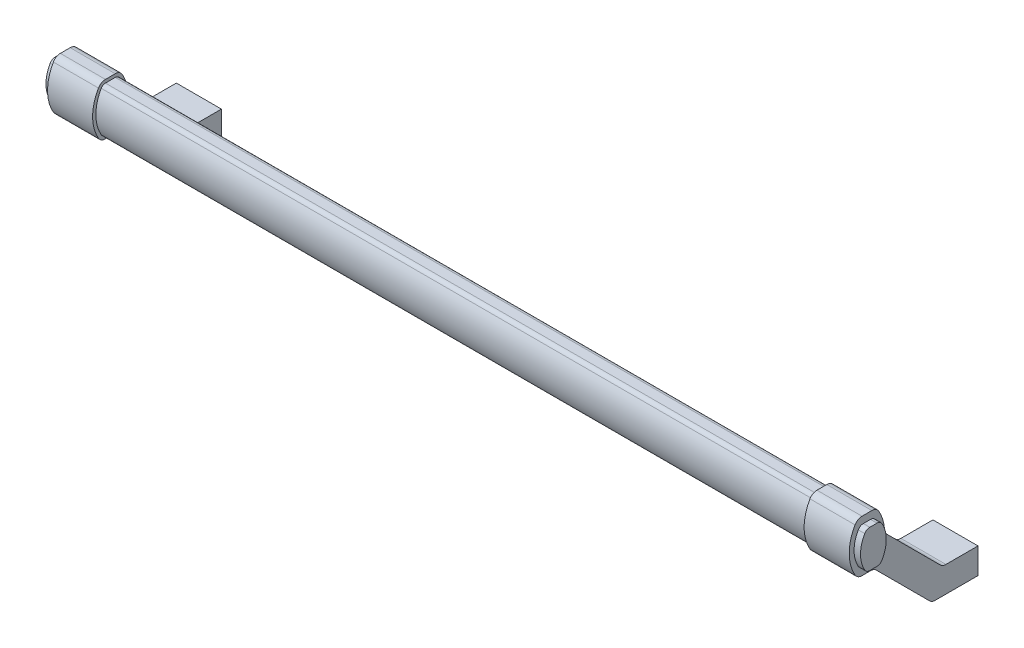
ISO-10303-21;
HEADER;
FILE_DESCRIPTION(('STEP AP214'),'2;1');
FILE_NAME('part.step','',(''),(''),'','','');
FILE_SCHEMA(('AUTOMOTIVE_DESIGN { 1 0 10303 214 1 1 1 1 }'));
ENDSEC;
DATA;
#1=APPLICATION_CONTEXT('core data for automotive mechanical design processes');
#2=APPLICATION_PROTOCOL_DEFINITION('international standard','automotive_design',2000,#1);
#3=PRODUCT_CONTEXT('',#1,'mechanical');
#4=PRODUCT('Part','Part','',(#3));
#5=PRODUCT_RELATED_PRODUCT_CATEGORY('part','',(#4));
#6=PRODUCT_DEFINITION_FORMATION('','',#4);
#7=PRODUCT_DEFINITION_CONTEXT('part definition',#1,'design');
#8=PRODUCT_DEFINITION('design','',#6,#7);
#9=PRODUCT_DEFINITION_SHAPE('','',#8);
#10=(LENGTH_UNIT() NAMED_UNIT(*) SI_UNIT(.MILLI.,.METRE.));
#11=(NAMED_UNIT(*) PLANE_ANGLE_UNIT() SI_UNIT($,.RADIAN.));
#12=(NAMED_UNIT(*) SI_UNIT($,.STERADIAN.) SOLID_ANGLE_UNIT());
#13=UNCERTAINTY_MEASURE_WITH_UNIT(LENGTH_MEASURE(1.E-05),#10,'distance_accuracy_value','');
#14=(GEOMETRIC_REPRESENTATION_CONTEXT(3) GLOBAL_UNCERTAINTY_ASSIGNED_CONTEXT((#13)) GLOBAL_UNIT_ASSIGNED_CONTEXT((#10,
#11,#12)) REPRESENTATION_CONTEXT('',''));
#15=CARTESIAN_POINT('',(0.,0.,0.));
#16=DIRECTION('',(0.,0.,1.));
#17=DIRECTION('',(1.,0.,0.));
#18=AXIS2_PLACEMENT_3D('',#15,#16,#17);
#19=CARTESIAN_POINT('',(-7.,4.,0.));
#20=DIRECTION('',(0.,0.,1.));
#21=DIRECTION('',(-1.,0.,0.));
#22=AXIS2_PLACEMENT_3D('',#19,#20,#21);
#23=PLANE('',#22);
#24=CARTESIAN_POINT('',(0.,0.,0.));
#25=DIRECTION('',(0.,0.,-1.));
#26=DIRECTION('',(1.,0.,0.));
#27=AXIS2_PLACEMENT_3D('',#24,#25,#26);
#28=CIRCLE('',#27,2.5);
#29=CARTESIAN_POINT('',(2.5,0.,0.));
#30=VERTEX_POINT('',#29);
#31=EDGE_CURVE('E610',#30,#30,#28,.T.);
#32=ORIENTED_EDGE('',*,*,#31,.F.);
#33=EDGE_LOOP('',(#32));
#34=FACE_BOUND('',#33,.T.);
#35=DIRECTION('',(1.,0.,0.));
#36=VECTOR('',#35,1.);
#37=CARTESIAN_POINT('',(-7.,-4.,0.));
#38=LINE('',#37,#36);
#39=CARTESIAN_POINT('',(-7.,-4.,0.));
#40=VERTEX_POINT('',#39);
#41=CARTESIAN_POINT('',(7.,-4.,0.));
#42=VERTEX_POINT('',#41);
#43=EDGE_CURVE('E9',#40,#42,#38,.T.);
#44=ORIENTED_EDGE('',*,*,#43,.F.);
#45=DIRECTION('',(0.,-1.,0.));
#46=VECTOR('',#45,1.);
#47=CARTESIAN_POINT('',(-7.,4.,0.));
#48=LINE('',#47,#46);
#49=CARTESIAN_POINT('',(-7.,4.,0.));
#50=VERTEX_POINT('',#49);
#51=EDGE_CURVE('E763',#50,#40,#48,.T.);
#52=ORIENTED_EDGE('',*,*,#51,.F.);
#53=DIRECTION('',(1.,0.,0.));
#54=VECTOR('',#53,1.);
#55=CARTESIAN_POINT('',(-7.,4.,0.));
#56=LINE('',#55,#54);
#57=CARTESIAN_POINT('',(7.,4.,0.));
#58=VERTEX_POINT('',#57);
#59=EDGE_CURVE('E811',#50,#58,#56,.T.);
#60=ORIENTED_EDGE('',*,*,#59,.T.);
#61=DIRECTION('',(0.,-1.,0.));
#62=VECTOR('',#61,1.);
#63=CARTESIAN_POINT('',(7.,4.,0.));
#64=LINE('',#63,#62);
#65=EDGE_CURVE('E715',#58,#42,#64,.T.);
#66=ORIENTED_EDGE('',*,*,#65,.T.);
#67=EDGE_LOOP('',(#44,#52,#60,#66));
#68=FACE_BOUND('',#67,.T.);
#69=ADVANCED_FACE('F14',(#34,#68),#23,.F.);
#70=CARTESIAN_POINT('',(-7.,-4.,0.));
#71=DIRECTION('',(0.,1.,0.));
#72=DIRECTION('',(-1.,0.,0.));
#73=AXIS2_PLACEMENT_3D('',#70,#71,#72);
#74=PLANE('',#73);
#75=DIRECTION('',(1.,0.,0.));
#76=VECTOR('',#75,1.);
#77=CARTESIAN_POINT('',(-7.,-4.,13.278174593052));
#78=LINE('',#77,#76);
#79=CARTESIAN_POINT('',(-7.,-4.,13.278174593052));
#80=VERTEX_POINT('',#79);
#81=CARTESIAN_POINT('',(7.,-4.,13.278174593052));
#82=VERTEX_POINT('',#81);
#83=EDGE_CURVE('E22',#80,#82,#78,.T.);
#84=ORIENTED_EDGE('',*,*,#83,.F.);
#85=DIRECTION('',(0.,0.,1.));
#86=VECTOR('',#85,1.);
#87=CARTESIAN_POINT('',(-7.,-4.,0.));
#88=LINE('',#87,#86);
#89=EDGE_CURVE('E766',#40,#80,#88,.T.);
#90=ORIENTED_EDGE('',*,*,#89,.F.);
#91=ORIENTED_EDGE('',*,*,#43,.T.);
#92=DIRECTION('',(0.,0.,1.));
#93=VECTOR('',#92,1.);
#94=CARTESIAN_POINT('',(7.,-4.,0.));
#95=LINE('',#94,#93);
#96=EDGE_CURVE('E718',#42,#82,#95,.T.);
#97=ORIENTED_EDGE('',*,*,#96,.T.);
#98=EDGE_LOOP('',(#84,#90,#91,#97));
#99=FACE_BOUND('',#98,.T.);
#100=ADVANCED_FACE('F16',(#99),#74,.F.);
#101=CARTESIAN_POINT('',(-7.,-1.5,13.278174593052));
#102=DIRECTION('',(1.,0.,0.));
#103=DIRECTION('',(0.,1.,0.));
#104=AXIS2_PLACEMENT_3D('',#101,#102,#103);
#105=CYLINDRICAL_SURFACE('',#104,2.49999999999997);
#106=DIRECTION('',(1.,0.,0.));
#107=VECTOR('',#106,1.);
#108=CARTESIAN_POINT('',(-7.,-3.2677669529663,15.0459415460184));
#109=LINE('',#108,#107);
#110=CARTESIAN_POINT('',(-7.,-3.2677669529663,15.0459415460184));
#111=VERTEX_POINT('',#110);
#112=CARTESIAN_POINT('',(7.,-3.2677669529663,15.0459415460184));
#113=VERTEX_POINT('',#112);
#114=EDGE_CURVE('E837',#111,#113,#109,.T.);
#115=ORIENTED_EDGE('',*,*,#114,.F.);
#116=CARTESIAN_POINT('',(-7.,-1.5,13.278174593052));
#117=DIRECTION('',(-1.,0.,0.));
#118=DIRECTION('',(0.,-1.,0.));
#119=AXIS2_PLACEMENT_3D('',#116,#117,#118);
#120=CIRCLE('',#119,2.49999999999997);
#121=EDGE_CURVE('E769',#80,#111,#120,.T.);
#122=ORIENTED_EDGE('',*,*,#121,.F.);
#123=ORIENTED_EDGE('',*,*,#83,.T.);
#124=CARTESIAN_POINT('',(7.,-1.5,13.278174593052));
#125=DIRECTION('',(-1.,0.,0.));
#126=DIRECTION('',(0.,-1.,0.));
#127=AXIS2_PLACEMENT_3D('',#124,#125,#126);
#128=CIRCLE('',#127,2.49999999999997);
#129=EDGE_CURVE('E721',#82,#113,#128,.T.);
#130=ORIENTED_EDGE('',*,*,#129,.T.);
#131=EDGE_LOOP('',(#115,#122,#123,#130));
#132=FACE_BOUND('',#131,.T.);
#133=ADVANCED_FACE('F840',(#132),#105,.T.);
#134=CARTESIAN_POINT('',(-7.,13.2677669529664,31.581475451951));
#135=DIRECTION('',(0.,-0.707106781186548,0.707106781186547));
#136=DIRECTION('',(0.,0.707106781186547,0.707106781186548));
#137=AXIS2_PLACEMENT_3D('',#134,#135,#136);
#138=PLANE('',#137);
#139=DIRECTION('',(1.,0.,0.));
#140=VECTOR('',#139,1.);
#141=CARTESIAN_POINT('',(-7.,13.2677669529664,31.581475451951));
#142=LINE('',#141,#140);
#143=CARTESIAN_POINT('',(-7.,13.2677669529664,31.581475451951));
#144=VERTEX_POINT('',#143);
#145=CARTESIAN_POINT('',(7.,13.2677669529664,31.581475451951));
#146=VERTEX_POINT('',#145);
#147=EDGE_CURVE('E835',#144,#146,#142,.T.);
#148=ORIENTED_EDGE('',*,*,#147,.F.);
#149=DIRECTION('',(0.,-0.707106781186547,-0.707106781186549));
#150=VECTOR('',#149,1.);
#151=CARTESIAN_POINT('',(-7.,13.2677669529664,31.581475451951));
#152=LINE('',#151,#150);
#153=EDGE_CURVE('E772',#144,#111,#152,.T.);
#154=ORIENTED_EDGE('',*,*,#153,.T.);
#155=ORIENTED_EDGE('',*,*,#114,.T.);
#156=DIRECTION('',(0.,-0.707106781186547,-0.707106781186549));
#157=VECTOR('',#156,1.);
#158=CARTESIAN_POINT('',(7.,13.2677669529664,31.581475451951));
#159=LINE('',#158,#157);
#160=EDGE_CURVE('E724',#146,#113,#159,.T.);
#161=ORIENTED_EDGE('',*,*,#160,.F.);
#162=EDGE_LOOP('',(#148,#154,#155,#161));
#163=FACE_BOUND('',#162,.T.);
#164=ADVANCED_FACE('F852',(#163),#138,.T.);
#165=CARTESIAN_POINT('',(-7.,11.5,33.3492424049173));
#166=DIRECTION('',(1.,0.,0.));
#167=DIRECTION('',(0.,1.,0.));
#168=AXIS2_PLACEMENT_3D('',#165,#166,#167);
#169=CYLINDRICAL_SURFACE('',#168,2.5);
#170=DIRECTION('',(1.,0.,0.));
#171=VECTOR('',#170,1.);
#172=CARTESIAN_POINT('',(-7.,14.,33.3492424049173));
#173=LINE('',#172,#171);
#174=CARTESIAN_POINT('',(-7.,14.,33.3492424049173));
#175=VERTEX_POINT('',#174);
#176=CARTESIAN_POINT('',(7.,14.,33.3492424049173));
#177=VERTEX_POINT('',#176);
#178=EDGE_CURVE('E833',#175,#177,#173,.T.);
#179=ORIENTED_EDGE('',*,*,#178,.F.);
#180=CARTESIAN_POINT('',(-7.,11.5,33.3492424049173));
#181=DIRECTION('',(-1.,0.,0.));
#182=DIRECTION('',(0.,-1.,0.));
#183=AXIS2_PLACEMENT_3D('',#180,#181,#182);
#184=CIRCLE('',#183,2.5);
#185=EDGE_CURVE('E775',#175,#144,#184,.T.);
#186=ORIENTED_EDGE('',*,*,#185,.T.);
#187=ORIENTED_EDGE('',*,*,#147,.T.);
#188=CARTESIAN_POINT('',(7.,11.5,33.3492424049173));
#189=DIRECTION('',(-1.,0.,0.));
#190=DIRECTION('',(0.,-1.,0.));
#191=AXIS2_PLACEMENT_3D('',#188,#189,#190);
#192=CIRCLE('',#191,2.5);
#193=EDGE_CURVE('E727',#177,#146,#192,.T.);
#194=ORIENTED_EDGE('',*,*,#193,.F.);
#195=EDGE_LOOP('',(#179,#186,#187,#194));
#196=FACE_BOUND('',#195,.T.);
#197=ADVANCED_FACE('F903',(#196),#169,.F.);
#198=CARTESIAN_POINT('',(-7.,14.,33.3492424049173));
#199=DIRECTION('',(0.,1.,0.));
#200=DIRECTION('',(-1.,0.,0.));
#201=AXIS2_PLACEMENT_3D('',#198,#199,#200);
#202=PLANE('',#201);
#203=DIRECTION('',(1.,0.,0.));
#204=VECTOR('',#203,1.);
#205=CARTESIAN_POINT('',(-7.,14.,36.0262794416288));
#206=LINE('',#205,#204);
#207=CARTESIAN_POINT('',(-7.,14.,36.0262794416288));
#208=VERTEX_POINT('',#207);
#209=CARTESIAN_POINT('',(7.,14.,36.0262794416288));
#210=VERTEX_POINT('',#209);
#211=EDGE_CURVE('E831',#208,#210,#206,.T.);
#212=ORIENTED_EDGE('',*,*,#211,.F.);
#213=DIRECTION('',(0.,0.,1.));
#214=VECTOR('',#213,1.);
#215=CARTESIAN_POINT('',(-7.,14.,33.3492424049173));
#216=LINE('',#215,#214);
#217=EDGE_CURVE('E778',#175,#208,#216,.T.);
#218=ORIENTED_EDGE('',*,*,#217,.F.);
#219=ORIENTED_EDGE('',*,*,#178,.T.);
#220=DIRECTION('',(0.,0.,1.));
#221=VECTOR('',#220,1.);
#222=CARTESIAN_POINT('',(7.,14.,33.3492424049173));
#223=LINE('',#222,#221);
#224=EDGE_CURVE('E730',#177,#210,#223,.T.);
#225=ORIENTED_EDGE('',*,*,#224,.T.);
#226=EDGE_LOOP('',(#212,#218,#219,#225));
#227=FACE_BOUND('',#226,.T.);
#228=ADVANCED_FACE('F901',(#227),#202,.F.);
#229=CARTESIAN_POINT('',(-7.,16.5,36.0262794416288));
#230=DIRECTION('',(1.,0.,0.));
#231=DIRECTION('',(0.,1.,0.));
#232=AXIS2_PLACEMENT_3D('',#229,#230,#231);
#233=CYLINDRICAL_SURFACE('',#232,2.5);
#234=DIRECTION('',(1.,0.,0.));
#235=VECTOR('',#234,1.);
#236=CARTESIAN_POINT('',(-7.,15.25,38.1913429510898));
#237=LINE('',#236,#235);
#238=CARTESIAN_POINT('',(-7.,15.25,38.1913429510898));
#239=VERTEX_POINT('',#238);
#240=CARTESIAN_POINT('',(7.,15.25,38.1913429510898));
#241=VERTEX_POINT('',#240);
#242=EDGE_CURVE('E829',#239,#241,#237,.T.);
#243=ORIENTED_EDGE('',*,*,#242,.F.);
#244=CARTESIAN_POINT('',(-7.,16.5,36.0262794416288));
#245=DIRECTION('',(-1.,0.,0.));
#246=DIRECTION('',(0.,-1.,0.));
#247=AXIS2_PLACEMENT_3D('',#244,#245,#246);
#248=CIRCLE('',#247,2.5);
#249=EDGE_CURVE('E781',#208,#239,#248,.T.);
#250=ORIENTED_EDGE('',*,*,#249,.F.);
#251=ORIENTED_EDGE('',*,*,#211,.T.);
#252=CARTESIAN_POINT('',(7.,16.5,36.0262794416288));
#253=DIRECTION('',(-1.,0.,0.));
#254=DIRECTION('',(0.,-1.,0.));
#255=AXIS2_PLACEMENT_3D('',#252,#253,#254);
#256=CIRCLE('',#255,2.5);
#257=EDGE_CURVE('E733',#210,#241,#256,.T.);
#258=ORIENTED_EDGE('',*,*,#257,.T.);
#259=EDGE_LOOP('',(#243,#250,#251,#258));
#260=FACE_BOUND('',#259,.T.);
#261=ADVANCED_FACE('F898',(#260),#233,.T.);
#262=CARTESIAN_POINT('',(-7.,22.,26.5));
#263=DIRECTION('',(1.,0.,0.));
#264=DIRECTION('',(0.,1.,0.));
#265=AXIS2_PLACEMENT_3D('',#262,#263,#264);
#266=CYLINDRICAL_SURFACE('',#265,13.5);
#267=DIRECTION('',(1.,0.,0.));
#268=VECTOR('',#267,1.);
#269=CARTESIAN_POINT('',(-7.,28.75,38.1913429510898));
#270=LINE('',#269,#268);
#271=CARTESIAN_POINT('',(-7.,28.75,38.1913429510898));
#272=VERTEX_POINT('',#271);
#273=CARTESIAN_POINT('',(7.,28.75,38.1913429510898));
#274=VERTEX_POINT('',#273);
#275=EDGE_CURVE('E827',#272,#274,#270,.T.);
#276=ORIENTED_EDGE('',*,*,#275,.F.);
#277=CARTESIAN_POINT('',(-7.,22.,26.5));
#278=DIRECTION('',(-1.,0.,0.));
#279=DIRECTION('',(0.,-1.,0.));
#280=AXIS2_PLACEMENT_3D('',#277,#278,#279);
#281=CIRCLE('',#280,13.5);
#282=EDGE_CURVE('E784',#239,#272,#281,.T.);
#283=ORIENTED_EDGE('',*,*,#282,.F.);
#284=ORIENTED_EDGE('',*,*,#242,.T.);
#285=CARTESIAN_POINT('',(7.,22.,26.5));
#286=DIRECTION('',(-1.,0.,0.));
#287=DIRECTION('',(0.,-1.,0.));
#288=AXIS2_PLACEMENT_3D('',#285,#286,#287);
#289=CIRCLE('',#288,13.5);
#290=EDGE_CURVE('E736',#241,#274,#289,.T.);
#291=ORIENTED_EDGE('',*,*,#290,.T.);
#292=EDGE_LOOP('',(#276,#283,#284,#291));
#293=FACE_BOUND('',#292,.T.);
#294=ADVANCED_FACE('F894',(#293),#266,.T.);
#295=CARTESIAN_POINT('',(-7.,27.5,36.0262794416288));
#296=DIRECTION('',(1.,0.,0.));
#297=DIRECTION('',(0.,1.,0.));
#298=AXIS2_PLACEMENT_3D('',#295,#296,#297);
#299=CYLINDRICAL_SURFACE('',#298,2.5);
#300=DIRECTION('',(1.,0.,0.));
#301=VECTOR('',#300,1.);
#302=CARTESIAN_POINT('',(-7.,30.,36.0262794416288));
#303=LINE('',#302,#301);
#304=CARTESIAN_POINT('',(-7.,30.,36.0262794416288));
#305=VERTEX_POINT('',#304);
#306=CARTESIAN_POINT('',(7.,30.,36.0262794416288));
#307=VERTEX_POINT('',#306);
#308=EDGE_CURVE('E825',#305,#307,#303,.T.);
#309=ORIENTED_EDGE('',*,*,#308,.F.);
#310=CARTESIAN_POINT('',(-7.,27.5,36.0262794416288));
#311=DIRECTION('',(-1.,0.,0.));
#312=DIRECTION('',(0.,-1.,0.));
#313=AXIS2_PLACEMENT_3D('',#310,#311,#312);
#314=CIRCLE('',#313,2.5);
#315=EDGE_CURVE('E787',#272,#305,#314,.T.);
#316=ORIENTED_EDGE('',*,*,#315,.F.);
#317=ORIENTED_EDGE('',*,*,#275,.T.);
#318=CARTESIAN_POINT('',(7.,27.5,36.0262794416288));
#319=DIRECTION('',(-1.,0.,0.));
#320=DIRECTION('',(0.,-1.,0.));
#321=AXIS2_PLACEMENT_3D('',#318,#319,#320);
#322=CIRCLE('',#321,2.5);
#323=EDGE_CURVE('E739',#274,#307,#322,.T.);
#324=ORIENTED_EDGE('',*,*,#323,.T.);
#325=EDGE_LOOP('',(#309,#316,#317,#324));
#326=FACE_BOUND('',#325,.T.);
#327=ADVANCED_FACE('F890',(#326),#299,.T.);
#328=CARTESIAN_POINT('',(-7.,30.,32.9737205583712));
#329=DIRECTION('',(0.,1.,0.));
#330=DIRECTION('',(-1.,0.,0.));
#331=AXIS2_PLACEMENT_3D('',#328,#329,#330);
#332=PLANE('',#331);
#333=DIRECTION('',(1.,0.,0.));
#334=VECTOR('',#333,1.);
#335=CARTESIAN_POINT('',(-7.,30.,32.9737205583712));
#336=LINE('',#335,#334);
#337=CARTESIAN_POINT('',(-7.,30.,32.9737205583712));
#338=VERTEX_POINT('',#337);
#339=CARTESIAN_POINT('',(7.,30.,32.9737205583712));
#340=VERTEX_POINT('',#339);
#341=EDGE_CURVE('E823',#338,#340,#336,.T.);
#342=ORIENTED_EDGE('',*,*,#341,.F.);
#343=DIRECTION('',(0.,0.,1.));
#344=VECTOR('',#343,1.);
#345=CARTESIAN_POINT('',(-7.,30.,32.9737205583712));
#346=LINE('',#345,#344);
#347=EDGE_CURVE('E790',#338,#305,#346,.T.);
#348=ORIENTED_EDGE('',*,*,#347,.T.);
#349=ORIENTED_EDGE('',*,*,#308,.T.);
#350=DIRECTION('',(0.,0.,1.));
#351=VECTOR('',#350,1.);
#352=CARTESIAN_POINT('',(7.,30.,32.9737205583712));
#353=LINE('',#352,#351);
#354=EDGE_CURVE('E742',#340,#307,#353,.T.);
#355=ORIENTED_EDGE('',*,*,#354,.F.);
#356=EDGE_LOOP('',(#342,#348,#349,#355));
#357=FACE_BOUND('',#356,.T.);
#358=ADVANCED_FACE('F887',(#357),#332,.T.);
#359=CARTESIAN_POINT('',(-7.,27.5,32.9737205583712));
#360=DIRECTION('',(1.,0.,0.));
#361=DIRECTION('',(0.,1.,0.));
#362=AXIS2_PLACEMENT_3D('',#359,#360,#361);
#363=CYLINDRICAL_SURFACE('',#362,2.5);
#364=DIRECTION('',(1.,0.,0.));
#365=VECTOR('',#364,1.);
#366=CARTESIAN_POINT('',(-7.,28.75,30.80865704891));
#367=LINE('',#366,#365);
#368=CARTESIAN_POINT('',(-7.,28.75,30.80865704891));
#369=VERTEX_POINT('',#368);
#370=CARTESIAN_POINT('',(7.,28.75,30.80865704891));
#371=VERTEX_POINT('',#370);
#372=EDGE_CURVE('E821',#369,#371,#367,.T.);
#373=ORIENTED_EDGE('',*,*,#372,.F.);
#374=CARTESIAN_POINT('',(-7.,27.5,32.9737205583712));
#375=DIRECTION('',(-1.,0.,0.));
#376=DIRECTION('',(0.,-1.,0.));
#377=AXIS2_PLACEMENT_3D('',#374,#375,#376);
#378=CIRCLE('',#377,2.5);
#379=EDGE_CURVE('E793',#338,#369,#378,.T.);
#380=ORIENTED_EDGE('',*,*,#379,.F.);
#381=ORIENTED_EDGE('',*,*,#341,.T.);
#382=CARTESIAN_POINT('',(7.,27.5,32.9737205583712));
#383=DIRECTION('',(-1.,0.,0.));
#384=DIRECTION('',(0.,-1.,0.));
#385=AXIS2_PLACEMENT_3D('',#382,#383,#384);
#386=CIRCLE('',#385,2.5);
#387=EDGE_CURVE('E745',#340,#371,#386,.T.);
#388=ORIENTED_EDGE('',*,*,#387,.T.);
#389=EDGE_LOOP('',(#373,#380,#381,#388));
#390=FACE_BOUND('',#389,.T.);
#391=ADVANCED_FACE('F883',(#390),#363,.T.);
#392=CARTESIAN_POINT('',(-7.,22.,42.5));
#393=DIRECTION('',(1.,0.,0.));
#394=DIRECTION('',(0.,1.,0.));
#395=AXIS2_PLACEMENT_3D('',#392,#393,#394);
#396=CYLINDRICAL_SURFACE('',#395,13.5);
#397=DIRECTION('',(1.,0.,0.));
#398=VECTOR('',#397,1.);
#399=CARTESIAN_POINT('',(-7.,22.9040353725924,29.0303036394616));
#400=LINE('',#399,#398);
#401=CARTESIAN_POINT('',(-7.,22.9040353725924,29.0303036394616));
#402=VERTEX_POINT('',#401);
#403=CARTESIAN_POINT('',(7.,22.9040353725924,29.0303036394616));
#404=VERTEX_POINT('',#403);
#405=EDGE_CURVE('E819',#402,#404,#400,.T.);
#406=ORIENTED_EDGE('',*,*,#405,.F.);
#407=CARTESIAN_POINT('',(-7.,22.,42.5));
#408=DIRECTION('',(-1.,0.,0.));
#409=DIRECTION('',(0.,-1.,0.));
#410=AXIS2_PLACEMENT_3D('',#407,#408,#409);
#411=CIRCLE('',#410,13.5);
#412=EDGE_CURVE('E796',#369,#402,#411,.T.);
#413=ORIENTED_EDGE('',*,*,#412,.F.);
#414=ORIENTED_EDGE('',*,*,#372,.T.);
#415=CARTESIAN_POINT('',(7.,22.,42.5));
#416=DIRECTION('',(-1.,0.,0.));
#417=DIRECTION('',(0.,-1.,0.));
#418=AXIS2_PLACEMENT_3D('',#415,#416,#417);
#419=CIRCLE('',#418,13.5);
#420=EDGE_CURVE('E748',#371,#404,#419,.T.);
#421=ORIENTED_EDGE('',*,*,#420,.T.);
#422=EDGE_LOOP('',(#406,#413,#414,#421));
#423=FACE_BOUND('',#422,.T.);
#424=ADVANCED_FACE('F878',(#423),#396,.T.);
#425=CARTESIAN_POINT('',(-7.,23.0714493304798,26.535915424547));
#426=DIRECTION('',(1.,0.,0.));
#427=DIRECTION('',(0.,1.,0.));
#428=AXIS2_PLACEMENT_3D('',#425,#426,#427);
#429=CYLINDRICAL_SURFACE('',#428,2.5);
#430=DIRECTION('',(1.,0.,0.));
#431=VECTOR('',#430,1.);
#432=CARTESIAN_POINT('',(-7.,21.3036823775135,28.3036823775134));
#433=LINE('',#432,#431);
#434=CARTESIAN_POINT('',(-7.,21.3036823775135,28.3036823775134));
#435=VERTEX_POINT('',#434);
#436=CARTESIAN_POINT('',(7.,21.3036823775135,28.3036823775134));
#437=VERTEX_POINT('',#436);
#438=EDGE_CURVE('E817',#435,#437,#433,.T.);
#439=ORIENTED_EDGE('',*,*,#438,.F.);
#440=CARTESIAN_POINT('',(-7.,23.0714493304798,26.535915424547));
#441=DIRECTION('',(-1.,0.,0.));
#442=DIRECTION('',(0.,-1.,0.));
#443=AXIS2_PLACEMENT_3D('',#440,#441,#442);
#444=CIRCLE('',#443,2.5);
#445=EDGE_CURVE('E799',#435,#402,#444,.T.);
#446=ORIENTED_EDGE('',*,*,#445,.T.);
#447=ORIENTED_EDGE('',*,*,#405,.T.);
#448=CARTESIAN_POINT('',(7.,23.0714493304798,26.535915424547));
#449=DIRECTION('',(-1.,0.,0.));
#450=DIRECTION('',(0.,-1.,0.));
#451=AXIS2_PLACEMENT_3D('',#448,#449,#450);
#452=CIRCLE('',#451,2.5);
#453=EDGE_CURVE('E751',#437,#404,#452,.T.);
#454=ORIENTED_EDGE('',*,*,#453,.F.);
#455=EDGE_LOOP('',(#439,#446,#447,#454));
#456=FACE_BOUND('',#455,.T.);
#457=ADVANCED_FACE('F875',(#456),#429,.F.);
#458=CARTESIAN_POINT('',(-7.,21.3036823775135,28.3036823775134));
#459=DIRECTION('',(0.,-0.707106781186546,0.707106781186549));
#460=DIRECTION('',(0.,0.707106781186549,0.707106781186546));
#461=AXIS2_PLACEMENT_3D('',#458,#459,#460);
#462=PLANE('',#461);
#463=DIRECTION('',(1.,0.,0.));
#464=VECTOR('',#463,1.);
#465=CARTESIAN_POINT('',(-7.,4.7322330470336,11.7322330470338));
#466=LINE('',#465,#464);
#467=CARTESIAN_POINT('',(-7.,4.7322330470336,11.7322330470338));
#468=VERTEX_POINT('',#467);
#469=CARTESIAN_POINT('',(7.,4.7322330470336,11.7322330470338));
#470=VERTEX_POINT('',#469);
#471=EDGE_CURVE('E815',#468,#470,#466,.T.);
#472=ORIENTED_EDGE('',*,*,#471,.F.);
#473=DIRECTION('',(0.,-0.707106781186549,-0.707106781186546));
#474=VECTOR('',#473,1.);
#475=CARTESIAN_POINT('',(-7.,21.3036823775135,28.3036823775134));
#476=LINE('',#475,#474);
#477=EDGE_CURVE('E802',#435,#468,#476,.T.);
#478=ORIENTED_EDGE('',*,*,#477,.F.);
#479=ORIENTED_EDGE('',*,*,#438,.T.);
#480=DIRECTION('',(0.,-0.707106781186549,-0.707106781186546));
#481=VECTOR('',#480,1.);
#482=CARTESIAN_POINT('',(7.,21.3036823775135,28.3036823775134));
#483=LINE('',#482,#481);
#484=EDGE_CURVE('E754',#437,#470,#483,.T.);
#485=ORIENTED_EDGE('',*,*,#484,.T.);
#486=EDGE_LOOP('',(#472,#478,#479,#485));
#487=FACE_BOUND('',#486,.T.);
#488=ADVANCED_FACE('F871',(#487),#462,.F.);
#489=CARTESIAN_POINT('',(-7.,6.5,9.9644660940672));
#490=DIRECTION('',(1.,0.,0.));
#491=DIRECTION('',(0.,1.,0.));
#492=AXIS2_PLACEMENT_3D('',#489,#490,#491);
#493=CYLINDRICAL_SURFACE('',#492,2.5);
#494=DIRECTION('',(1.,0.,0.));
#495=VECTOR('',#494,1.);
#496=CARTESIAN_POINT('',(-7.,4.,9.9644660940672));
#497=LINE('',#496,#495);
#498=CARTESIAN_POINT('',(-7.,4.,9.9644660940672));
#499=VERTEX_POINT('',#498);
#500=CARTESIAN_POINT('',(7.,4.,9.9644660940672));
#501=VERTEX_POINT('',#500);
#502=EDGE_CURVE('E813',#499,#501,#497,.T.);
#503=ORIENTED_EDGE('',*,*,#502,.F.);
#504=CARTESIAN_POINT('',(-7.,6.5,9.9644660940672));
#505=DIRECTION('',(-1.,0.,0.));
#506=DIRECTION('',(0.,-1.,0.));
#507=AXIS2_PLACEMENT_3D('',#504,#505,#506);
#508=CIRCLE('',#507,2.5);
#509=EDGE_CURVE('E805',#499,#468,#508,.T.);
#510=ORIENTED_EDGE('',*,*,#509,.T.);
#511=ORIENTED_EDGE('',*,*,#471,.T.);
#512=CARTESIAN_POINT('',(7.,6.5,9.9644660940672));
#513=DIRECTION('',(-1.,0.,0.));
#514=DIRECTION('',(0.,-1.,0.));
#515=AXIS2_PLACEMENT_3D('',#512,#513,#514);
#516=CIRCLE('',#515,2.5);
#517=EDGE_CURVE('E757',#501,#470,#516,.T.);
#518=ORIENTED_EDGE('',*,*,#517,.F.);
#519=EDGE_LOOP('',(#503,#510,#511,#518));
#520=FACE_BOUND('',#519,.T.);
#521=ADVANCED_FACE('F866',(#520),#493,.F.);
#522=CARTESIAN_POINT('',(-7.,4.,0.));
#523=DIRECTION('',(0.,1.,0.));
#524=DIRECTION('',(-1.,0.,0.));
#525=AXIS2_PLACEMENT_3D('',#522,#523,#524);
#526=PLANE('',#525);
#527=DIRECTION('',(0.,0.,1.));
#528=VECTOR('',#527,1.);
#529=CARTESIAN_POINT('',(-7.,4.,0.));
#530=LINE('',#529,#528);
#531=EDGE_CURVE('E808',#50,#499,#530,.T.);
#532=ORIENTED_EDGE('',*,*,#531,.T.);
#533=ORIENTED_EDGE('',*,*,#502,.T.);
#534=DIRECTION('',(0.,0.,1.));
#535=VECTOR('',#534,1.);
#536=CARTESIAN_POINT('',(7.,4.,0.));
#537=LINE('',#536,#535);
#538=EDGE_CURVE('E760',#58,#501,#537,.T.);
#539=ORIENTED_EDGE('',*,*,#538,.F.);
#540=ORIENTED_EDGE('',*,*,#59,.F.);
#541=EDGE_LOOP('',(#532,#533,#539,#540));
#542=FACE_BOUND('',#541,.T.);
#543=ADVANCED_FACE('F863',(#542),#526,.T.);
#544=CARTESIAN_POINT('',(-7.,-1.5,13.278174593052));
#545=DIRECTION('',(-1.,0.,0.));
#546=DIRECTION('',(0.,-1.,0.));
#547=AXIS2_PLACEMENT_3D('',#544,#545,#546);
#548=PLANE('',#547);
#549=CARTESIAN_POINT('',(-7.,18.,35.6100214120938));
#550=DIRECTION('',(-1.,0.,0.));
#551=DIRECTION('',(0.,-1.,0.));
#552=AXIS2_PLACEMENT_3D('',#549,#550,#551);
#553=CIRCLE('',#552,1.81818181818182);
#554=CARTESIAN_POINT('',(-7.,16.1818181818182,35.6100214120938));
#555=VERTEX_POINT('',#554);
#556=CARTESIAN_POINT('',(-7.,17.0909090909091,37.1846130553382));
#557=VERTEX_POINT('',#556);
#558=EDGE_CURVE('E37',#555,#557,#553,.T.);
#559=ORIENTED_EDGE('',*,*,#558,.F.);
#560=DIRECTION('',(0.,0.,1.));
#561=VECTOR('',#560,1.);
#562=CARTESIAN_POINT('',(-7.,16.1818181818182,33.3899785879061));
#563=LINE('',#562,#561);
#564=CARTESIAN_POINT('',(-7.,16.1818181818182,33.3899785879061));
#565=VERTEX_POINT('',#564);
#566=EDGE_CURVE('E665',#565,#555,#563,.T.);
#567=ORIENTED_EDGE('',*,*,#566,.F.);
#568=CARTESIAN_POINT('',(-7.,18.,33.3899785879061));
#569=DIRECTION('',(-1.,0.,0.));
#570=DIRECTION('',(0.,-1.,0.));
#571=AXIS2_PLACEMENT_3D('',#568,#569,#570);
#572=CIRCLE('',#571,1.81818181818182);
#573=CARTESIAN_POINT('',(-7.,17.0909090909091,31.8153869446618));
#574=VERTEX_POINT('',#573);
#575=EDGE_CURVE('E662',#574,#565,#572,.T.);
#576=ORIENTED_EDGE('',*,*,#575,.F.);
#577=CARTESIAN_POINT('',(-7.,22.,40.3181818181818));
#578=DIRECTION('',(-1.,0.,0.));
#579=DIRECTION('',(0.,-1.,0.));
#580=AXIS2_PLACEMENT_3D('',#577,#578,#579);
#581=CIRCLE('',#580,9.81818181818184);
#582=CARTESIAN_POINT('',(-7.,26.909090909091,31.8153869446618));
#583=VERTEX_POINT('',#582);
#584=EDGE_CURVE('E659',#583,#574,#581,.T.);
#585=ORIENTED_EDGE('',*,*,#584,.F.);
#586=CARTESIAN_POINT('',(-7.,26.,33.3899785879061));
#587=DIRECTION('',(-1.,0.,0.));
#588=DIRECTION('',(0.,-1.,0.));
#589=AXIS2_PLACEMENT_3D('',#586,#587,#588);
#590=CIRCLE('',#589,1.81818181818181);
#591=CARTESIAN_POINT('',(-7.,27.8181818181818,33.3899785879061));
#592=VERTEX_POINT('',#591);
#593=EDGE_CURVE('E656',#592,#583,#590,.T.);
#594=ORIENTED_EDGE('',*,*,#593,.F.);
#595=DIRECTION('',(0.,0.,1.));
#596=VECTOR('',#595,1.);
#597=CARTESIAN_POINT('',(-7.,27.8181818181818,33.3899785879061));
#598=LINE('',#597,#596);
#599=CARTESIAN_POINT('',(-7.,27.8181818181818,35.6100214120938));
#600=VERTEX_POINT('',#599);
#601=EDGE_CURVE('E654',#592,#600,#598,.T.);
#602=ORIENTED_EDGE('',*,*,#601,.T.);
#603=CARTESIAN_POINT('',(-7.,26.,35.6100214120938));
#604=DIRECTION('',(-1.,0.,0.));
#605=DIRECTION('',(0.,-1.,0.));
#606=AXIS2_PLACEMENT_3D('',#603,#604,#605);
#607=CIRCLE('',#606,1.81818181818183);
#608=CARTESIAN_POINT('',(-7.,26.909090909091,37.1846130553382));
#609=VERTEX_POINT('',#608);
#610=EDGE_CURVE('E651',#609,#600,#607,.T.);
#611=ORIENTED_EDGE('',*,*,#610,.F.);
#612=CARTESIAN_POINT('',(-7.,22.,28.6818181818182));
#613=DIRECTION('',(-1.,0.,0.));
#614=DIRECTION('',(0.,-1.,0.));
#615=AXIS2_PLACEMENT_3D('',#612,#613,#614);
#616=CIRCLE('',#615,9.81818181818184);
#617=EDGE_CURVE('E648',#557,#609,#616,.T.);
#618=ORIENTED_EDGE('',*,*,#617,.F.);
#619=EDGE_LOOP('',(#559,#567,#576,#585,#594,#602,#611,#618));
#620=FACE_BOUND('',#619,.T.);
#621=ORIENTED_EDGE('',*,*,#51,.T.);
#622=ORIENTED_EDGE('',*,*,#89,.T.);
#623=ORIENTED_EDGE('',*,*,#121,.T.);
#624=ORIENTED_EDGE('',*,*,#153,.F.);
#625=ORIENTED_EDGE('',*,*,#185,.F.);
#626=ORIENTED_EDGE('',*,*,#217,.T.);
#627=ORIENTED_EDGE('',*,*,#249,.T.);
#628=ORIENTED_EDGE('',*,*,#282,.T.);
#629=ORIENTED_EDGE('',*,*,#315,.T.);
#630=ORIENTED_EDGE('',*,*,#347,.F.);
#631=ORIENTED_EDGE('',*,*,#379,.T.);
#632=ORIENTED_EDGE('',*,*,#412,.T.);
#633=ORIENTED_EDGE('',*,*,#445,.F.);
#634=ORIENTED_EDGE('',*,*,#477,.T.);
#635=ORIENTED_EDGE('',*,*,#509,.F.);
#636=ORIENTED_EDGE('',*,*,#531,.F.);
#637=EDGE_LOOP('',(#621,#622,#623,#624,#625,#626,#627,#628,#629,#630,#631,#632,#633,#634,#635,#636));
#638=FACE_BOUND('',#637,.T.);
#639=ADVANCED_FACE('F855',(#620,#638),#548,.T.);
#640=CARTESIAN_POINT('',(7.,-1.5,13.278174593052));
#641=DIRECTION('',(-1.,0.,0.));
#642=DIRECTION('',(0.,-1.,0.));
#643=AXIS2_PLACEMENT_3D('',#640,#641,#642);
#644=PLANE('',#643);
#645=CARTESIAN_POINT('',(7.,27.5,32.973720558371));
#646=DIRECTION('',(-1.,0.,0.));
#647=DIRECTION('',(0.,-1.,0.));
#648=AXIS2_PLACEMENT_3D('',#645,#646,#647);
#649=CIRCLE('',#648,1.5);
#650=CARTESIAN_POINT('',(7.,29.,32.9737205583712));
#651=VERTEX_POINT('',#650);
#652=CARTESIAN_POINT('',(7.,28.25,31.6746824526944));
#653=VERTEX_POINT('',#652);
#654=EDGE_CURVE('E374',#651,#653,#649,.T.);
#655=ORIENTED_EDGE('',*,*,#654,.T.);
#656=CARTESIAN_POINT('',(7.,22.,42.5));
#657=DIRECTION('',(-1.,0.,0.));
#658=DIRECTION('',(0.,-1.,0.));
#659=AXIS2_PLACEMENT_3D('',#656,#657,#658);
#660=CIRCLE('',#659,12.5);
#661=CARTESIAN_POINT('',(7.,15.75,31.6746824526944));
#662=VERTEX_POINT('',#661);
#663=EDGE_CURVE('E29',#653,#662,#660,.T.);
#664=ORIENTED_EDGE('',*,*,#663,.T.);
#665=CARTESIAN_POINT('',(7.,16.5,32.973720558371));
#666=DIRECTION('',(-1.,0.,0.));
#667=DIRECTION('',(0.,-1.,0.));
#668=AXIS2_PLACEMENT_3D('',#665,#666,#667);
#669=CIRCLE('',#668,1.49999999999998);
#670=CARTESIAN_POINT('',(7.,15.,32.973720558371));
#671=VERTEX_POINT('',#670);
#672=EDGE_CURVE('E371',#662,#671,#669,.T.);
#673=ORIENTED_EDGE('',*,*,#672,.T.);
#674=DIRECTION('',(0.,0.,1.));
#675=VECTOR('',#674,1.);
#676=CARTESIAN_POINT('',(7.,15.,32.973720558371));
#677=LINE('',#676,#675);
#678=CARTESIAN_POINT('',(7.,15.,36.0262794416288));
#679=VERTEX_POINT('',#678);
#680=EDGE_CURVE('E618',#671,#679,#677,.T.);
#681=ORIENTED_EDGE('',*,*,#680,.T.);
#682=CARTESIAN_POINT('',(7.,16.5,36.0262794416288));
#683=DIRECTION('',(1.,0.,0.));
#684=DIRECTION('',(0.,1.,0.));
#685=AXIS2_PLACEMENT_3D('',#682,#683,#684);
#686=CIRCLE('',#685,1.49999999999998);
#687=CARTESIAN_POINT('',(7.,15.75,37.3253175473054));
#688=VERTEX_POINT('',#687);
#689=EDGE_CURVE('E621',#688,#679,#686,.T.);
#690=ORIENTED_EDGE('',*,*,#689,.F.);
#691=CARTESIAN_POINT('',(7.,22.,26.5));
#692=DIRECTION('',(1.,0.,0.));
#693=DIRECTION('',(0.,1.,0.));
#694=AXIS2_PLACEMENT_3D('',#691,#692,#693);
#695=CIRCLE('',#694,12.5);
#696=CARTESIAN_POINT('',(7.,28.25,37.3253175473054));
#697=VERTEX_POINT('',#696);
#698=EDGE_CURVE('E624',#697,#688,#695,.T.);
#699=ORIENTED_EDGE('',*,*,#698,.F.);
#700=CARTESIAN_POINT('',(7.,27.5,36.0262794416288));
#701=DIRECTION('',(1.,0.,0.));
#702=DIRECTION('',(0.,1.,0.));
#703=AXIS2_PLACEMENT_3D('',#700,#701,#702);
#704=CIRCLE('',#703,1.5);
#705=CARTESIAN_POINT('',(7.,29.,36.0262794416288));
#706=VERTEX_POINT('',#705);
#707=EDGE_CURVE('E627',#706,#697,#704,.T.);
#708=ORIENTED_EDGE('',*,*,#707,.F.);
#709=DIRECTION('',(0.,0.,1.));
#710=VECTOR('',#709,1.);
#711=CARTESIAN_POINT('',(7.,29.,32.9737205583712));
#712=LINE('',#711,#710);
#713=EDGE_CURVE('E630',#651,#706,#712,.T.);
#714=ORIENTED_EDGE('',*,*,#713,.F.);
#715=EDGE_LOOP('',(#655,#664,#673,#681,#690,#699,#708,#714));
#716=FACE_BOUND('',#715,.T.);
#717=ORIENTED_EDGE('',*,*,#65,.F.);
#718=ORIENTED_EDGE('',*,*,#538,.T.);
#719=ORIENTED_EDGE('',*,*,#517,.T.);
#720=ORIENTED_EDGE('',*,*,#484,.F.);
#721=ORIENTED_EDGE('',*,*,#453,.T.);
#722=ORIENTED_EDGE('',*,*,#420,.F.);
#723=ORIENTED_EDGE('',*,*,#387,.F.);
#724=ORIENTED_EDGE('',*,*,#354,.T.);
#725=ORIENTED_EDGE('',*,*,#323,.F.);
#726=ORIENTED_EDGE('',*,*,#290,.F.);
#727=ORIENTED_EDGE('',*,*,#257,.F.);
#728=ORIENTED_EDGE('',*,*,#224,.F.);
#729=ORIENTED_EDGE('',*,*,#193,.T.);
#730=ORIENTED_EDGE('',*,*,#160,.T.);
#731=ORIENTED_EDGE('',*,*,#129,.F.);
#732=ORIENTED_EDGE('',*,*,#96,.F.);
#733=EDGE_LOOP('',(#717,#718,#719,#720,#721,#722,#723,#724,#725,#726,#727,#728,#729,#730,#731,#732));
#734=FACE_BOUND('',#733,.T.);
#735=ADVANCED_FACE('F847',(#716,#734),#644,.F.);
#736=CARTESIAN_POINT('',(-9.,18.,35.6100214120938));
#737=DIRECTION('',(1.,0.,0.));
#738=DIRECTION('',(0.,1.,0.));
#739=AXIS2_PLACEMENT_3D('',#736,#737,#738);
#740=CYLINDRICAL_SURFACE('',#739,1.81818181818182);
#741=DIRECTION('',(1.,0.,0.));
#742=VECTOR('',#741,1.);
#743=CARTESIAN_POINT('',(-9.,17.0909090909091,37.1846130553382));
#744=LINE('',#743,#742);
#745=CARTESIAN_POINT('',(-9.,17.0909090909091,37.1846130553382));
#746=VERTEX_POINT('',#745);
#747=EDGE_CURVE('E712',#746,#557,#744,.T.);
#748=ORIENTED_EDGE('',*,*,#747,.F.);
#749=CARTESIAN_POINT('',(-9.,18.,35.6100214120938));
#750=DIRECTION('',(-1.,0.,0.));
#751=DIRECTION('',(0.,-1.,0.));
#752=AXIS2_PLACEMENT_3D('',#749,#750,#751);
#753=CIRCLE('',#752,1.81818181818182);
#754=CARTESIAN_POINT('',(-9.,16.1818181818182,35.6100214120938));
#755=VERTEX_POINT('',#754);
#756=EDGE_CURVE('E668',#755,#746,#753,.T.);
#757=ORIENTED_EDGE('',*,*,#756,.F.);
#758=DIRECTION('',(1.,0.,0.));
#759=VECTOR('',#758,1.);
#760=CARTESIAN_POINT('',(-9.,16.1818181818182,35.6100214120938));
#761=LINE('',#760,#759);
#762=EDGE_CURVE('E692',#755,#555,#761,.T.);
#763=ORIENTED_EDGE('',*,*,#762,.T.);
#764=ORIENTED_EDGE('',*,*,#558,.T.);
#765=EDGE_LOOP('',(#748,#757,#763,#764));
#766=FACE_BOUND('',#765,.T.);
#767=ADVANCED_FACE('F995',(#766),#740,.T.);
#768=CARTESIAN_POINT('',(-9.,22.,28.6818181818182));
#769=DIRECTION('',(1.,0.,0.));
#770=DIRECTION('',(0.,1.,0.));
#771=AXIS2_PLACEMENT_3D('',#768,#769,#770);
#772=CYLINDRICAL_SURFACE('',#771,9.81818181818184);
#773=DIRECTION('',(1.,0.,0.));
#774=VECTOR('',#773,1.);
#775=CARTESIAN_POINT('',(-9.,26.909090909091,37.1846130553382));
#776=LINE('',#775,#774);
#777=CARTESIAN_POINT('',(-9.,26.909090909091,37.1846130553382));
#778=VERTEX_POINT('',#777);
#779=EDGE_CURVE('E709',#778,#609,#776,.T.);
#780=ORIENTED_EDGE('',*,*,#779,.F.);
#781=CARTESIAN_POINT('',(-9.,22.,28.6818181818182));
#782=DIRECTION('',(-1.,0.,0.));
#783=DIRECTION('',(0.,-1.,0.));
#784=AXIS2_PLACEMENT_3D('',#781,#782,#783);
#785=CIRCLE('',#784,9.81818181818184);
#786=EDGE_CURVE('E671',#746,#778,#785,.T.);
#787=ORIENTED_EDGE('',*,*,#786,.F.);
#788=ORIENTED_EDGE('',*,*,#747,.T.);
#789=ORIENTED_EDGE('',*,*,#617,.T.);
#790=EDGE_LOOP('',(#780,#787,#788,#789));
#791=FACE_BOUND('',#790,.T.);
#792=ADVANCED_FACE('F1002',(#791),#772,.T.);
#793=CARTESIAN_POINT('',(-9.,26.,35.6100214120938));
#794=DIRECTION('',(1.,0.,0.));
#795=DIRECTION('',(0.,1.,0.));
#796=AXIS2_PLACEMENT_3D('',#793,#794,#795);
#797=CYLINDRICAL_SURFACE('',#796,1.81818181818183);
#798=DIRECTION('',(1.,0.,0.));
#799=VECTOR('',#798,1.);
#800=CARTESIAN_POINT('',(-9.,27.8181818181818,35.6100214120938));
#801=LINE('',#800,#799);
#802=CARTESIAN_POINT('',(-9.,27.8181818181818,35.6100214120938));
#803=VERTEX_POINT('',#802);
#804=EDGE_CURVE('E706',#803,#600,#801,.T.);
#805=ORIENTED_EDGE('',*,*,#804,.F.);
#806=CARTESIAN_POINT('',(-9.,26.,35.6100214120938));
#807=DIRECTION('',(-1.,0.,0.));
#808=DIRECTION('',(0.,-1.,0.));
#809=AXIS2_PLACEMENT_3D('',#806,#807,#808);
#810=CIRCLE('',#809,1.81818181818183);
#811=EDGE_CURVE('E674',#778,#803,#810,.T.);
#812=ORIENTED_EDGE('',*,*,#811,.F.);
#813=ORIENTED_EDGE('',*,*,#779,.T.);
#814=ORIENTED_EDGE('',*,*,#610,.T.);
#815=EDGE_LOOP('',(#805,#812,#813,#814));
#816=FACE_BOUND('',#815,.T.);
#817=ADVANCED_FACE('F1010',(#816),#797,.T.);
#818=CARTESIAN_POINT('',(-9.,27.8181818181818,33.3899785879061));
#819=DIRECTION('',(0.,1.,0.));
#820=DIRECTION('',(-1.,0.,0.));
#821=AXIS2_PLACEMENT_3D('',#818,#819,#820);
#822=PLANE('',#821);
#823=DIRECTION('',(1.,0.,0.));
#824=VECTOR('',#823,1.);
#825=CARTESIAN_POINT('',(-9.,27.8181818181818,33.3899785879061));
#826=LINE('',#825,#824);
#827=CARTESIAN_POINT('',(-9.,27.8181818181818,33.3899785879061));
#828=VERTEX_POINT('',#827);
#829=EDGE_CURVE('E703',#828,#592,#826,.T.);
#830=ORIENTED_EDGE('',*,*,#829,.F.);
#831=DIRECTION('',(0.,0.,1.));
#832=VECTOR('',#831,1.);
#833=CARTESIAN_POINT('',(-9.,27.8181818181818,33.3899785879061));
#834=LINE('',#833,#832);
#835=EDGE_CURVE('E677',#828,#803,#834,.T.);
#836=ORIENTED_EDGE('',*,*,#835,.T.);
#837=ORIENTED_EDGE('',*,*,#804,.T.);
#838=ORIENTED_EDGE('',*,*,#601,.F.);
#839=EDGE_LOOP('',(#830,#836,#837,#838));
#840=FACE_BOUND('',#839,.T.);
#841=ADVANCED_FACE('F1018',(#840),#822,.T.);
#842=CARTESIAN_POINT('',(-9.,26.,33.3899785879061));
#843=DIRECTION('',(1.,0.,0.));
#844=DIRECTION('',(0.,1.,0.));
#845=AXIS2_PLACEMENT_3D('',#842,#843,#844);
#846=CYLINDRICAL_SURFACE('',#845,1.81818181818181);
#847=DIRECTION('',(1.,0.,0.));
#848=VECTOR('',#847,1.);
#849=CARTESIAN_POINT('',(-9.,26.909090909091,31.8153869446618));
#850=LINE('',#849,#848);
#851=CARTESIAN_POINT('',(-9.,26.909090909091,31.8153869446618));
#852=VERTEX_POINT('',#851);
#853=EDGE_CURVE('E700',#852,#583,#850,.T.);
#854=ORIENTED_EDGE('',*,*,#853,.F.);
#855=CARTESIAN_POINT('',(-9.,26.,33.3899785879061));
#856=DIRECTION('',(-1.,0.,0.));
#857=DIRECTION('',(0.,-1.,0.));
#858=AXIS2_PLACEMENT_3D('',#855,#856,#857);
#859=CIRCLE('',#858,1.81818181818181);
#860=EDGE_CURVE('E680',#828,#852,#859,.T.);
#861=ORIENTED_EDGE('',*,*,#860,.F.);
#862=ORIENTED_EDGE('',*,*,#829,.T.);
#863=ORIENTED_EDGE('',*,*,#593,.T.);
#864=EDGE_LOOP('',(#854,#861,#862,#863));
#865=FACE_BOUND('',#864,.T.);
#866=ADVANCED_FACE('F1026',(#865),#846,.T.);
#867=CARTESIAN_POINT('',(-9.,22.,40.3181818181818));
#868=DIRECTION('',(1.,0.,0.));
#869=DIRECTION('',(0.,1.,0.));
#870=AXIS2_PLACEMENT_3D('',#867,#868,#869);
#871=CYLINDRICAL_SURFACE('',#870,9.81818181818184);
#872=DIRECTION('',(1.,0.,0.));
#873=VECTOR('',#872,1.);
#874=CARTESIAN_POINT('',(-9.,17.0909090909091,31.8153869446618));
#875=LINE('',#874,#873);
#876=CARTESIAN_POINT('',(-9.,17.0909090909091,31.8153869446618));
#877=VERTEX_POINT('',#876);
#878=EDGE_CURVE('E697',#877,#574,#875,.T.);
#879=ORIENTED_EDGE('',*,*,#878,.F.);
#880=CARTESIAN_POINT('',(-9.,22.,40.3181818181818));
#881=DIRECTION('',(-1.,0.,0.));
#882=DIRECTION('',(0.,-1.,0.));
#883=AXIS2_PLACEMENT_3D('',#880,#881,#882);
#884=CIRCLE('',#883,9.81818181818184);
#885=EDGE_CURVE('E683',#852,#877,#884,.T.);
#886=ORIENTED_EDGE('',*,*,#885,.F.);
#887=ORIENTED_EDGE('',*,*,#853,.T.);
#888=ORIENTED_EDGE('',*,*,#584,.T.);
#889=EDGE_LOOP('',(#879,#886,#887,#888));
#890=FACE_BOUND('',#889,.T.);
#891=ADVANCED_FACE('F1034',(#890),#871,.T.);
#892=CARTESIAN_POINT('',(-9.,18.,33.3899785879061));
#893=DIRECTION('',(1.,0.,0.));
#894=DIRECTION('',(0.,1.,0.));
#895=AXIS2_PLACEMENT_3D('',#892,#893,#894);
#896=CYLINDRICAL_SURFACE('',#895,1.81818181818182);
#897=DIRECTION('',(1.,0.,0.));
#898=VECTOR('',#897,1.);
#899=CARTESIAN_POINT('',(-9.,16.1818181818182,33.3899785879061));
#900=LINE('',#899,#898);
#901=CARTESIAN_POINT('',(-9.,16.1818181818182,33.3899785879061));
#902=VERTEX_POINT('',#901);
#903=EDGE_CURVE('E694',#902,#565,#900,.T.);
#904=ORIENTED_EDGE('',*,*,#903,.F.);
#905=CARTESIAN_POINT('',(-9.,18.,33.3899785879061));
#906=DIRECTION('',(-1.,0.,0.));
#907=DIRECTION('',(0.,-1.,0.));
#908=AXIS2_PLACEMENT_3D('',#905,#906,#907);
#909=CIRCLE('',#908,1.81818181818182);
#910=EDGE_CURVE('E686',#877,#902,#909,.T.);
#911=ORIENTED_EDGE('',*,*,#910,.F.);
#912=ORIENTED_EDGE('',*,*,#878,.T.);
#913=ORIENTED_EDGE('',*,*,#575,.T.);
#914=EDGE_LOOP('',(#904,#911,#912,#913));
#915=FACE_BOUND('',#914,.T.);
#916=ADVANCED_FACE('F1042',(#915),#896,.T.);
#917=CARTESIAN_POINT('',(-9.,16.1818181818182,33.3899785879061));
#918=DIRECTION('',(0.,1.,0.));
#919=DIRECTION('',(0.,0.,-1.));
#920=AXIS2_PLACEMENT_3D('',#917,#918,#919);
#921=PLANE('',#920);
#922=DIRECTION('',(0.,0.,1.));
#923=VECTOR('',#922,1.);
#924=CARTESIAN_POINT('',(-9.,16.1818181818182,33.3899785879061));
#925=LINE('',#924,#923);
#926=EDGE_CURVE('E689',#902,#755,#925,.T.);
#927=ORIENTED_EDGE('',*,*,#926,.F.);
#928=ORIENTED_EDGE('',*,*,#903,.T.);
#929=ORIENTED_EDGE('',*,*,#566,.T.);
#930=ORIENTED_EDGE('',*,*,#762,.F.);
#931=EDGE_LOOP('',(#927,#928,#929,#930));
#932=FACE_BOUND('',#931,.T.);
#933=ADVANCED_FACE('F1050',(#932),#921,.F.);
#934=CARTESIAN_POINT('',(-9.,18.,35.6100214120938));
#935=DIRECTION('',(-1.,0.,0.));
#936=DIRECTION('',(0.,-1.,0.));
#937=AXIS2_PLACEMENT_3D('',#934,#935,#936);
#938=PLANE('',#937);
#939=ORIENTED_EDGE('',*,*,#756,.T.);
#940=ORIENTED_EDGE('',*,*,#786,.T.);
#941=ORIENTED_EDGE('',*,*,#811,.T.);
#942=ORIENTED_EDGE('',*,*,#835,.F.);
#943=ORIENTED_EDGE('',*,*,#860,.T.);
#944=ORIENTED_EDGE('',*,*,#885,.T.);
#945=ORIENTED_EDGE('',*,*,#910,.T.);
#946=ORIENTED_EDGE('',*,*,#926,.T.);
#947=EDGE_LOOP('',(#939,#940,#941,#942,#943,#944,#945,#946));
#948=FACE_BOUND('',#947,.T.);
#949=ADVANCED_FACE('F1053',(#948),#938,.T.);
#950=CARTESIAN_POINT('',(117.5,22.,42.5));
#951=DIRECTION('',(-1.,0.,0.));
#952=DIRECTION('',(0.,-1.,0.));
#953=AXIS2_PLACEMENT_3D('',#950,#951,#952);
#954=CYLINDRICAL_SURFACE('',#953,12.5);
#955=DIRECTION('',(-1.,0.,0.));
#956=VECTOR('',#955,1.);
#957=CARTESIAN_POINT('',(117.5,28.25,31.6746824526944));
#958=LINE('',#957,#956);
#959=CARTESIAN_POINT('',(228.,28.25,31.6746824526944));
#960=VERTEX_POINT('',#959);
#961=EDGE_CURVE('E389',#960,#653,#958,.T.);
#962=ORIENTED_EDGE('',*,*,#961,.F.);
#963=CARTESIAN_POINT('',(228.,22.,42.5));
#964=DIRECTION('',(-1.,0.,0.));
#965=DIRECTION('',(0.,-1.,0.));
#966=AXIS2_PLACEMENT_3D('',#963,#964,#965);
#967=CIRCLE('',#966,12.5);
#968=CARTESIAN_POINT('',(228.,15.75,31.6746824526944));
#969=VERTEX_POINT('',#968);
#970=EDGE_CURVE('E382',#960,#969,#967,.T.);
#971=ORIENTED_EDGE('',*,*,#970,.T.);
#972=DIRECTION('',(-1.,0.,0.));
#973=VECTOR('',#972,1.);
#974=CARTESIAN_POINT('',(117.5,15.75,31.6746824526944));
#975=LINE('',#974,#973);
#976=EDGE_CURVE('E366',#969,#662,#975,.T.);
#977=ORIENTED_EDGE('',*,*,#976,.T.);
#978=ORIENTED_EDGE('',*,*,#663,.F.);
#979=EDGE_LOOP('',(#962,#971,#977,#978));
#980=FACE_BOUND('',#979,.T.);
#981=ADVANCED_FACE('F388',(#980),#954,.T.);
#982=CARTESIAN_POINT('',(117.5,27.5,32.973720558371));
#983=DIRECTION('',(-1.,0.,0.));
#984=DIRECTION('',(0.,-1.,0.));
#985=AXIS2_PLACEMENT_3D('',#982,#983,#984);
#986=CYLINDRICAL_SURFACE('',#985,1.5);
#987=DIRECTION('',(-1.,0.,0.));
#988=VECTOR('',#987,1.);
#989=CARTESIAN_POINT('',(117.5,29.,32.9737205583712));
#990=LINE('',#989,#988);
#991=CARTESIAN_POINT('',(228.,29.,32.9737205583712));
#992=VERTEX_POINT('',#991);
#993=EDGE_CURVE('E644',#992,#651,#990,.T.);
#994=ORIENTED_EDGE('',*,*,#993,.F.);
#995=CARTESIAN_POINT('',(228.,27.5,32.973720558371));
#996=DIRECTION('',(-1.,0.,0.));
#997=DIRECTION('',(0.,-1.,0.));
#998=AXIS2_PLACEMENT_3D('',#995,#996,#997);
#999=CIRCLE('',#998,1.5);
#1000=EDGE_CURVE('E409',#992,#960,#999,.T.);
#1001=ORIENTED_EDGE('',*,*,#1000,.T.);
#1002=ORIENTED_EDGE('',*,*,#961,.T.);
#1003=ORIENTED_EDGE('',*,*,#654,.F.);
#1004=EDGE_LOOP('',(#994,#1001,#1002,#1003));
#1005=FACE_BOUND('',#1004,.T.);
#1006=ADVANCED_FACE('F1073',(#1005),#986,.T.);
#1007=CARTESIAN_POINT('',(117.5,29.,32.9737205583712));
#1008=DIRECTION('',(0.,-1.,0.));
#1009=DIRECTION('',(1.,0.,0.));
#1010=AXIS2_PLACEMENT_3D('',#1007,#1008,#1009);
#1011=PLANE('',#1010);
#1012=DIRECTION('',(-1.,0.,0.));
#1013=VECTOR('',#1012,1.);
#1014=CARTESIAN_POINT('',(117.5,29.,36.0262794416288));
#1015=LINE('',#1014,#1013);
#1016=CARTESIAN_POINT('',(228.,29.,36.0262794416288));
#1017=VERTEX_POINT('',#1016);
#1018=EDGE_CURVE('E642',#1017,#706,#1015,.T.);
#1019=ORIENTED_EDGE('',*,*,#1018,.F.);
#1020=DIRECTION('',(0.,0.,1.));
#1021=VECTOR('',#1020,1.);
#1022=CARTESIAN_POINT('',(228.,29.,32.9737205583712));
#1023=LINE('',#1022,#1021);
#1024=EDGE_CURVE('E406',#992,#1017,#1023,.T.);
#1025=ORIENTED_EDGE('',*,*,#1024,.F.);
#1026=ORIENTED_EDGE('',*,*,#993,.T.);
#1027=ORIENTED_EDGE('',*,*,#713,.T.);
#1028=EDGE_LOOP('',(#1019,#1025,#1026,#1027));
#1029=FACE_BOUND('',#1028,.T.);
#1030=ADVANCED_FACE('F1080',(#1029),#1011,.F.);
#1031=CARTESIAN_POINT('',(117.5,27.5,36.0262794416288));
#1032=DIRECTION('',(-1.,0.,0.));
#1033=DIRECTION('',(0.,-1.,0.));
#1034=AXIS2_PLACEMENT_3D('',#1031,#1032,#1033);
#1035=CYLINDRICAL_SURFACE('',#1034,1.5);
#1036=DIRECTION('',(-1.,0.,0.));
#1037=VECTOR('',#1036,1.);
#1038=CARTESIAN_POINT('',(117.5,28.25,37.3253175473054));
#1039=LINE('',#1038,#1037);
#1040=CARTESIAN_POINT('',(228.,28.25,37.3253175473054));
#1041=VERTEX_POINT('',#1040);
#1042=EDGE_CURVE('E640',#1041,#697,#1039,.T.);
#1043=ORIENTED_EDGE('',*,*,#1042,.F.);
#1044=CARTESIAN_POINT('',(228.,27.5,36.0262794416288));
#1045=DIRECTION('',(1.,0.,0.));
#1046=DIRECTION('',(0.,1.,0.));
#1047=AXIS2_PLACEMENT_3D('',#1044,#1045,#1046);
#1048=CIRCLE('',#1047,1.5);
#1049=EDGE_CURVE('E403',#1017,#1041,#1048,.T.);
#1050=ORIENTED_EDGE('',*,*,#1049,.F.);
#1051=ORIENTED_EDGE('',*,*,#1018,.T.);
#1052=ORIENTED_EDGE('',*,*,#707,.T.);
#1053=EDGE_LOOP('',(#1043,#1050,#1051,#1052));
#1054=FACE_BOUND('',#1053,.T.);
#1055=ADVANCED_FACE('F1088',(#1054),#1035,.T.);
#1056=CARTESIAN_POINT('',(117.5,22.,26.5));
#1057=DIRECTION('',(-1.,0.,0.));
#1058=DIRECTION('',(0.,-1.,0.));
#1059=AXIS2_PLACEMENT_3D('',#1056,#1057,#1058);
#1060=CYLINDRICAL_SURFACE('',#1059,12.5);
#1061=DIRECTION('',(-1.,0.,0.));
#1062=VECTOR('',#1061,1.);
#1063=CARTESIAN_POINT('',(117.5,15.75,37.3253175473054));
#1064=LINE('',#1063,#1062);
#1065=CARTESIAN_POINT('',(228.,15.75,37.3253175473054));
#1066=VERTEX_POINT('',#1065);
#1067=EDGE_CURVE('E638',#1066,#688,#1064,.T.);
#1068=ORIENTED_EDGE('',*,*,#1067,.F.);
#1069=CARTESIAN_POINT('',(228.,22.,26.5));
#1070=DIRECTION('',(1.,0.,0.));
#1071=DIRECTION('',(0.,1.,0.));
#1072=AXIS2_PLACEMENT_3D('',#1069,#1070,#1071);
#1073=CIRCLE('',#1072,12.5);
#1074=EDGE_CURVE('E400',#1041,#1066,#1073,.T.);
#1075=ORIENTED_EDGE('',*,*,#1074,.F.);
#1076=ORIENTED_EDGE('',*,*,#1042,.T.);
#1077=ORIENTED_EDGE('',*,*,#698,.T.);
#1078=EDGE_LOOP('',(#1068,#1075,#1076,#1077));
#1079=FACE_BOUND('',#1078,.T.);
#1080=ADVANCED_FACE('F1096',(#1079),#1060,.T.);
#1081=CARTESIAN_POINT('',(117.5,16.5,36.0262794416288));
#1082=DIRECTION('',(-1.,0.,0.));
#1083=DIRECTION('',(0.,-1.,0.));
#1084=AXIS2_PLACEMENT_3D('',#1081,#1082,#1083);
#1085=CYLINDRICAL_SURFACE('',#1084,1.49999999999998);
#1086=DIRECTION('',(-1.,0.,0.));
#1087=VECTOR('',#1086,1.);
#1088=CARTESIAN_POINT('',(117.5,15.,36.0262794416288));
#1089=LINE('',#1088,#1087);
#1090=CARTESIAN_POINT('',(228.,15.,36.0262794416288));
#1091=VERTEX_POINT('',#1090);
#1092=EDGE_CURVE('E636',#1091,#679,#1089,.T.);
#1093=ORIENTED_EDGE('',*,*,#1092,.F.);
#1094=CARTESIAN_POINT('',(228.,16.5,36.0262794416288));
#1095=DIRECTION('',(1.,0.,0.));
#1096=DIRECTION('',(0.,1.,0.));
#1097=AXIS2_PLACEMENT_3D('',#1094,#1095,#1096);
#1098=CIRCLE('',#1097,1.49999999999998);
#1099=EDGE_CURVE('E398',#1066,#1091,#1098,.T.);
#1100=ORIENTED_EDGE('',*,*,#1099,.F.);
#1101=ORIENTED_EDGE('',*,*,#1067,.T.);
#1102=ORIENTED_EDGE('',*,*,#689,.T.);
#1103=EDGE_LOOP('',(#1093,#1100,#1101,#1102));
#1104=FACE_BOUND('',#1103,.T.);
#1105=ADVANCED_FACE('F1104',(#1104),#1085,.T.);
#1106=CARTESIAN_POINT('',(117.5,15.,32.973720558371));
#1107=DIRECTION('',(0.,-1.,0.));
#1108=DIRECTION('',(1.,0.,0.));
#1109=AXIS2_PLACEMENT_3D('',#1106,#1107,#1108);
#1110=PLANE('',#1109);
#1111=DIRECTION('',(-1.,0.,0.));
#1112=VECTOR('',#1111,1.);
#1113=CARTESIAN_POINT('',(117.5,15.,32.973720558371));
#1114=LINE('',#1113,#1112);
#1115=CARTESIAN_POINT('',(228.,15.,32.973720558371));
#1116=VERTEX_POINT('',#1115);
#1117=EDGE_CURVE('E373',#1116,#671,#1114,.T.);
#1118=ORIENTED_EDGE('',*,*,#1117,.F.);
#1119=DIRECTION('',(0.,0.,1.));
#1120=VECTOR('',#1119,1.);
#1121=CARTESIAN_POINT('',(228.,15.,32.973720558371));
#1122=LINE('',#1121,#1120);
#1123=EDGE_CURVE('E386',#1116,#1091,#1122,.T.);
#1124=ORIENTED_EDGE('',*,*,#1123,.T.);
#1125=ORIENTED_EDGE('',*,*,#1092,.T.);
#1126=ORIENTED_EDGE('',*,*,#680,.F.);
#1127=EDGE_LOOP('',(#1118,#1124,#1125,#1126));
#1128=FACE_BOUND('',#1127,.T.);
#1129=ADVANCED_FACE('F1112',(#1128),#1110,.T.);
#1130=CARTESIAN_POINT('',(117.5,16.5,32.973720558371));
#1131=DIRECTION('',(-1.,0.,0.));
#1132=DIRECTION('',(0.,-1.,0.));
#1133=AXIS2_PLACEMENT_3D('',#1130,#1131,#1132);
#1134=CYLINDRICAL_SURFACE('',#1133,1.49999999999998);
#1135=ORIENTED_EDGE('',*,*,#976,.F.);
#1136=CARTESIAN_POINT('',(228.,16.5,32.973720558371));
#1137=DIRECTION('',(-1.,0.,0.));
#1138=DIRECTION('',(0.,-1.,0.));
#1139=AXIS2_PLACEMENT_3D('',#1136,#1137,#1138);
#1140=CIRCLE('',#1139,1.49999999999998);
#1141=EDGE_CURVE('E369',#969,#1116,#1140,.T.);
#1142=ORIENTED_EDGE('',*,*,#1141,.T.);
#1143=ORIENTED_EDGE('',*,*,#1117,.T.);
#1144=ORIENTED_EDGE('',*,*,#672,.F.);
#1145=EDGE_LOOP('',(#1135,#1142,#1143,#1144));
#1146=FACE_BOUND('',#1145,.T.);
#1147=ADVANCED_FACE('F368',(#1146),#1134,.T.);
#1148=CARTESIAN_POINT('',(0.,0.,10.));
#1149=DIRECTION('',(0.,0.,-1.));
#1150=DIRECTION('',(1.,0.,0.));
#1151=AXIS2_PLACEMENT_3D('',#1148,#1149,#1150);
#1152=CYLINDRICAL_SURFACE('',#1151,2.5);
#1153=CARTESIAN_POINT('',(0.,0.,10.));
#1154=DIRECTION('',(0.,0.,-1.));
#1155=DIRECTION('',(1.,0.,0.));
#1156=AXIS2_PLACEMENT_3D('',#1153,#1154,#1155);
#1157=CIRCLE('',#1156,2.5);
#1158=CARTESIAN_POINT('',(2.5,0.,10.));
#1159=VERTEX_POINT('',#1158);
#1160=EDGE_CURVE('E613',#1159,#1159,#1157,.T.);
#1161=ORIENTED_EDGE('',*,*,#1160,.F.);
#1162=EDGE_LOOP('',(#1161));
#1163=FACE_BOUND('',#1162,.T.);
#1164=ORIENTED_EDGE('',*,*,#31,.T.);
#1165=EDGE_LOOP('',(#1164));
#1166=FACE_BOUND('',#1165,.T.);
#1167=ADVANCED_FACE('F1127',(#1163,#1166),#1152,.F.);
#1168=CARTESIAN_POINT('',(0.,0.,10.));
#1169=DIRECTION('',(0.,0.,-1.));
#1170=DIRECTION('',(1.,0.,0.));
#1171=AXIS2_PLACEMENT_3D('',#1168,#1169,#1170);
#1172=PLANE('',#1171);
#1173=ORIENTED_EDGE('',*,*,#1160,.T.);
#1174=EDGE_LOOP('',(#1173));
#1175=FACE_BOUND('',#1174,.T.);
#1176=ADVANCED_FACE('F1129',(#1175),#1172,.T.);
#1177=CARTESIAN_POINT('',(242.,4.,0.));
#1178=DIRECTION('',(0.,0.,1.));
#1179=DIRECTION('',(1.,0.,0.));
#1180=AXIS2_PLACEMENT_3D('',#1177,#1178,#1179);
#1181=PLANE('',#1180);
#1182=CARTESIAN_POINT('',(235.,0.,0.));
#1183=DIRECTION('',(0.,0.,1.));
#1184=DIRECTION('',(-1.,0.,0.));
#1185=AXIS2_PLACEMENT_3D('',#1182,#1183,#1184);
#1186=CIRCLE('',#1185,2.5);
#1187=CARTESIAN_POINT('',(232.5,0.,0.));
#1188=VERTEX_POINT('',#1187);
#1189=EDGE_CURVE('E393',#1188,#1188,#1186,.T.);
#1190=ORIENTED_EDGE('',*,*,#1189,.T.);
#1191=EDGE_LOOP('',(#1190));
#1192=FACE_BOUND('',#1191,.T.);
#1193=DIRECTION('',(-1.,0.,0.));
#1194=VECTOR('',#1193,1.);
#1195=CARTESIAN_POINT('',(242.,-4.,0.));
#1196=LINE('',#1195,#1194);
#1197=CARTESIAN_POINT('',(242.,-4.,0.));
#1198=VERTEX_POINT('',#1197);
#1199=CARTESIAN_POINT('',(228.,-4.,0.));
#1200=VERTEX_POINT('',#1199);
#1201=EDGE_CURVE('E608',#1198,#1200,#1196,.T.);
#1202=ORIENTED_EDGE('',*,*,#1201,.T.);
#1203=DIRECTION('',(0.,-1.,0.));
#1204=VECTOR('',#1203,1.);
#1205=CARTESIAN_POINT('',(228.,4.,0.));
#1206=LINE('',#1205,#1204);
#1207=CARTESIAN_POINT('',(228.,4.,0.));
#1208=VERTEX_POINT('',#1207);
#1209=EDGE_CURVE('E482',#1208,#1200,#1206,.T.);
#1210=ORIENTED_EDGE('',*,*,#1209,.F.);
#1211=DIRECTION('',(-1.,0.,0.));
#1212=VECTOR('',#1211,1.);
#1213=CARTESIAN_POINT('',(242.,4.,0.));
#1214=LINE('',#1213,#1212);
#1215=CARTESIAN_POINT('',(242.,4.,0.));
#1216=VERTEX_POINT('',#1215);
#1217=EDGE_CURVE('E578',#1216,#1208,#1214,.T.);
#1218=ORIENTED_EDGE('',*,*,#1217,.F.);
#1219=DIRECTION('',(0.,-1.,0.));
#1220=VECTOR('',#1219,1.);
#1221=CARTESIAN_POINT('',(242.,4.,0.));
#1222=LINE('',#1221,#1220);
#1223=EDGE_CURVE('E530',#1216,#1198,#1222,.T.);
#1224=ORIENTED_EDGE('',*,*,#1223,.T.);
#1225=EDGE_LOOP('',(#1202,#1210,#1218,#1224));
#1226=FACE_BOUND('',#1225,.T.);
#1227=ADVANCED_FACE('F1137',(#1192,#1226),#1181,.F.);
#1228=CARTESIAN_POINT('',(242.,-4.,0.));
#1229=DIRECTION('',(0.,1.,0.));
#1230=DIRECTION('',(1.,0.,0.));
#1231=AXIS2_PLACEMENT_3D('',#1228,#1229,#1230);
#1232=PLANE('',#1231);
#1233=DIRECTION('',(-1.,0.,0.));
#1234=VECTOR('',#1233,1.);
#1235=CARTESIAN_POINT('',(242.,-4.,13.278174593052));
#1236=LINE('',#1235,#1234);
#1237=CARTESIAN_POINT('',(242.,-4.,13.278174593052));
#1238=VERTEX_POINT('',#1237);
#1239=CARTESIAN_POINT('',(228.,-4.,13.278174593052));
#1240=VERTEX_POINT('',#1239);
#1241=EDGE_CURVE('E606',#1238,#1240,#1236,.T.);
#1242=ORIENTED_EDGE('',*,*,#1241,.T.);
#1243=DIRECTION('',(0.,0.,1.));
#1244=VECTOR('',#1243,1.);
#1245=CARTESIAN_POINT('',(228.,-4.,0.));
#1246=LINE('',#1245,#1244);
#1247=EDGE_CURVE('E485',#1200,#1240,#1246,.T.);
#1248=ORIENTED_EDGE('',*,*,#1247,.F.);
#1249=ORIENTED_EDGE('',*,*,#1201,.F.);
#1250=DIRECTION('',(0.,0.,1.));
#1251=VECTOR('',#1250,1.);
#1252=CARTESIAN_POINT('',(242.,-4.,0.));
#1253=LINE('',#1252,#1251);
#1254=EDGE_CURVE('E533',#1198,#1238,#1253,.T.);
#1255=ORIENTED_EDGE('',*,*,#1254,.T.);
#1256=EDGE_LOOP('',(#1242,#1248,#1249,#1255));
#1257=FACE_BOUND('',#1256,.T.);
#1258=ADVANCED_FACE('F1150',(#1257),#1232,.F.);
#1259=CARTESIAN_POINT('',(242.,-1.5,13.278174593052));
#1260=DIRECTION('',(-1.,0.,0.));
#1261=DIRECTION('',(0.,1.,0.));
#1262=AXIS2_PLACEMENT_3D('',#1259,#1260,#1261);
#1263=CYLINDRICAL_SURFACE('',#1262,2.49999999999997);
#1264=DIRECTION('',(-1.,0.,0.));
#1265=VECTOR('',#1264,1.);
#1266=CARTESIAN_POINT('',(242.,-3.2677669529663,15.0459415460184));
#1267=LINE('',#1266,#1265);
#1268=CARTESIAN_POINT('',(242.,-3.2677669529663,15.0459415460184));
#1269=VERTEX_POINT('',#1268);
#1270=CARTESIAN_POINT('',(228.,-3.2677669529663,15.0459415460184));
#1271=VERTEX_POINT('',#1270);
#1272=EDGE_CURVE('E604',#1269,#1271,#1267,.T.);
#1273=ORIENTED_EDGE('',*,*,#1272,.T.);
#1274=CARTESIAN_POINT('',(228.,-1.5,13.278174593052));
#1275=DIRECTION('',(-1.,0.,0.));
#1276=DIRECTION('',(0.,-1.,0.));
#1277=AXIS2_PLACEMENT_3D('',#1274,#1275,#1276);
#1278=CIRCLE('',#1277,2.49999999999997);
#1279=EDGE_CURVE('E488',#1240,#1271,#1278,.T.);
#1280=ORIENTED_EDGE('',*,*,#1279,.F.);
#1281=ORIENTED_EDGE('',*,*,#1241,.F.);
#1282=CARTESIAN_POINT('',(242.,-1.5,13.278174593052));
#1283=DIRECTION('',(-1.,0.,0.));
#1284=DIRECTION('',(0.,-1.,0.));
#1285=AXIS2_PLACEMENT_3D('',#1282,#1283,#1284);
#1286=CIRCLE('',#1285,2.49999999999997);
#1287=EDGE_CURVE('E536',#1238,#1269,#1286,.T.);
#1288=ORIENTED_EDGE('',*,*,#1287,.T.);
#1289=EDGE_LOOP('',(#1273,#1280,#1281,#1288));
#1290=FACE_BOUND('',#1289,.T.);
#1291=ADVANCED_FACE('F1158',(#1290),#1263,.T.);
#1292=CARTESIAN_POINT('',(242.,13.2677669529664,31.581475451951));
#1293=DIRECTION('',(0.,-0.707106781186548,0.707106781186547));
#1294=DIRECTION('',(0.,0.707106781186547,0.707106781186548));
#1295=AXIS2_PLACEMENT_3D('',#1292,#1293,#1294);
#1296=PLANE('',#1295);
#1297=DIRECTION('',(-1.,0.,0.));
#1298=VECTOR('',#1297,1.);
#1299=CARTESIAN_POINT('',(242.,13.2677669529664,31.581475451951));
#1300=LINE('',#1299,#1298);
#1301=CARTESIAN_POINT('',(242.,13.2677669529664,31.581475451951));
#1302=VERTEX_POINT('',#1301);
#1303=CARTESIAN_POINT('',(228.,13.2677669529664,31.581475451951));
#1304=VERTEX_POINT('',#1303);
#1305=EDGE_CURVE('E602',#1302,#1304,#1300,.T.);
#1306=ORIENTED_EDGE('',*,*,#1305,.T.);
#1307=DIRECTION('',(0.,-0.707106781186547,-0.707106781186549));
#1308=VECTOR('',#1307,1.);
#1309=CARTESIAN_POINT('',(228.,13.2677669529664,31.581475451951));
#1310=LINE('',#1309,#1308);
#1311=EDGE_CURVE('E491',#1304,#1271,#1310,.T.);
#1312=ORIENTED_EDGE('',*,*,#1311,.T.);
#1313=ORIENTED_EDGE('',*,*,#1272,.F.);
#1314=DIRECTION('',(0.,-0.707106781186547,-0.707106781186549));
#1315=VECTOR('',#1314,1.);
#1316=CARTESIAN_POINT('',(242.,13.2677669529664,31.581475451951));
#1317=LINE('',#1316,#1315);
#1318=EDGE_CURVE('E539',#1302,#1269,#1317,.T.);
#1319=ORIENTED_EDGE('',*,*,#1318,.F.);
#1320=EDGE_LOOP('',(#1306,#1312,#1313,#1319));
#1321=FACE_BOUND('',#1320,.T.);
#1322=ADVANCED_FACE('F1166',(#1321),#1296,.T.);
#1323=CARTESIAN_POINT('',(242.,11.5,33.3492424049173));
#1324=DIRECTION('',(-1.,0.,0.));
#1325=DIRECTION('',(0.,1.,0.));
#1326=AXIS2_PLACEMENT_3D('',#1323,#1324,#1325);
#1327=CYLINDRICAL_SURFACE('',#1326,2.5);
#1328=DIRECTION('',(-1.,0.,0.));
#1329=VECTOR('',#1328,1.);
#1330=CARTESIAN_POINT('',(242.,14.,33.3492424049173));
#1331=LINE('',#1330,#1329);
#1332=CARTESIAN_POINT('',(242.,14.,33.3492424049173));
#1333=VERTEX_POINT('',#1332);
#1334=CARTESIAN_POINT('',(228.,14.,33.3492424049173));
#1335=VERTEX_POINT('',#1334);
#1336=EDGE_CURVE('E600',#1333,#1335,#1331,.T.);
#1337=ORIENTED_EDGE('',*,*,#1336,.T.);
#1338=CARTESIAN_POINT('',(228.,11.5,33.3492424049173));
#1339=DIRECTION('',(-1.,0.,0.));
#1340=DIRECTION('',(0.,-1.,0.));
#1341=AXIS2_PLACEMENT_3D('',#1338,#1339,#1340);
#1342=CIRCLE('',#1341,2.5);
#1343=EDGE_CURVE('E494',#1335,#1304,#1342,.T.);
#1344=ORIENTED_EDGE('',*,*,#1343,.T.);
#1345=ORIENTED_EDGE('',*,*,#1305,.F.);
#1346=CARTESIAN_POINT('',(242.,11.5,33.3492424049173));
#1347=DIRECTION('',(-1.,0.,0.));
#1348=DIRECTION('',(0.,-1.,0.));
#1349=AXIS2_PLACEMENT_3D('',#1346,#1347,#1348);
#1350=CIRCLE('',#1349,2.5);
#1351=EDGE_CURVE('E542',#1333,#1302,#1350,.T.);
#1352=ORIENTED_EDGE('',*,*,#1351,.F.);
#1353=EDGE_LOOP('',(#1337,#1344,#1345,#1352));
#1354=FACE_BOUND('',#1353,.T.);
#1355=ADVANCED_FACE('F1174',(#1354),#1327,.F.);
#1356=CARTESIAN_POINT('',(242.,14.,33.3492424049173));
#1357=DIRECTION('',(0.,1.,0.));
#1358=DIRECTION('',(1.,0.,0.));
#1359=AXIS2_PLACEMENT_3D('',#1356,#1357,#1358);
#1360=PLANE('',#1359);
#1361=DIRECTION('',(-1.,0.,0.));
#1362=VECTOR('',#1361,1.);
#1363=CARTESIAN_POINT('',(242.,14.,36.0262794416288));
#1364=LINE('',#1363,#1362);
#1365=CARTESIAN_POINT('',(242.,14.,36.0262794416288));
#1366=VERTEX_POINT('',#1365);
#1367=CARTESIAN_POINT('',(228.,14.,36.0262794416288));
#1368=VERTEX_POINT('',#1367);
#1369=EDGE_CURVE('E598',#1366,#1368,#1364,.T.);
#1370=ORIENTED_EDGE('',*,*,#1369,.T.);
#1371=DIRECTION('',(0.,0.,1.));
#1372=VECTOR('',#1371,1.);
#1373=CARTESIAN_POINT('',(228.,14.,33.3492424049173));
#1374=LINE('',#1373,#1372);
#1375=EDGE_CURVE('E497',#1335,#1368,#1374,.T.);
#1376=ORIENTED_EDGE('',*,*,#1375,.F.);
#1377=ORIENTED_EDGE('',*,*,#1336,.F.);
#1378=DIRECTION('',(0.,0.,1.));
#1379=VECTOR('',#1378,1.);
#1380=CARTESIAN_POINT('',(242.,14.,33.3492424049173));
#1381=LINE('',#1380,#1379);
#1382=EDGE_CURVE('E545',#1333,#1366,#1381,.T.);
#1383=ORIENTED_EDGE('',*,*,#1382,.T.);
#1384=EDGE_LOOP('',(#1370,#1376,#1377,#1383));
#1385=FACE_BOUND('',#1384,.T.);
#1386=ADVANCED_FACE('F1182',(#1385),#1360,.F.);
#1387=CARTESIAN_POINT('',(242.,16.5,36.0262794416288));
#1388=DIRECTION('',(-1.,0.,0.));
#1389=DIRECTION('',(0.,1.,0.));
#1390=AXIS2_PLACEMENT_3D('',#1387,#1388,#1389);
#1391=CYLINDRICAL_SURFACE('',#1390,2.5);
#1392=DIRECTION('',(-1.,0.,0.));
#1393=VECTOR('',#1392,1.);
#1394=CARTESIAN_POINT('',(242.,15.25,38.1913429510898));
#1395=LINE('',#1394,#1393);
#1396=CARTESIAN_POINT('',(242.,15.25,38.1913429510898));
#1397=VERTEX_POINT('',#1396);
#1398=CARTESIAN_POINT('',(228.,15.25,38.1913429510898));
#1399=VERTEX_POINT('',#1398);
#1400=EDGE_CURVE('E596',#1397,#1399,#1395,.T.);
#1401=ORIENTED_EDGE('',*,*,#1400,.T.);
#1402=CARTESIAN_POINT('',(228.,16.5,36.0262794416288));
#1403=DIRECTION('',(-1.,0.,0.));
#1404=DIRECTION('',(0.,-1.,0.));
#1405=AXIS2_PLACEMENT_3D('',#1402,#1403,#1404);
#1406=CIRCLE('',#1405,2.5);
#1407=EDGE_CURVE('E500',#1368,#1399,#1406,.T.);
#1408=ORIENTED_EDGE('',*,*,#1407,.F.);
#1409=ORIENTED_EDGE('',*,*,#1369,.F.);
#1410=CARTESIAN_POINT('',(242.,16.5,36.0262794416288));
#1411=DIRECTION('',(-1.,0.,0.));
#1412=DIRECTION('',(0.,-1.,0.));
#1413=AXIS2_PLACEMENT_3D('',#1410,#1411,#1412);
#1414=CIRCLE('',#1413,2.5);
#1415=EDGE_CURVE('E548',#1366,#1397,#1414,.T.);
#1416=ORIENTED_EDGE('',*,*,#1415,.T.);
#1417=EDGE_LOOP('',(#1401,#1408,#1409,#1416));
#1418=FACE_BOUND('',#1417,.T.);
#1419=ADVANCED_FACE('F1190',(#1418),#1391,.T.);
#1420=CARTESIAN_POINT('',(242.,22.,26.5));
#1421=DIRECTION('',(-1.,0.,0.));
#1422=DIRECTION('',(0.,1.,0.));
#1423=AXIS2_PLACEMENT_3D('',#1420,#1421,#1422);
#1424=CYLINDRICAL_SURFACE('',#1423,13.5);
#1425=DIRECTION('',(-1.,0.,0.));
#1426=VECTOR('',#1425,1.);
#1427=CARTESIAN_POINT('',(242.,28.75,38.1913429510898));
#1428=LINE('',#1427,#1426);
#1429=CARTESIAN_POINT('',(242.,28.75,38.1913429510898));
#1430=VERTEX_POINT('',#1429);
#1431=CARTESIAN_POINT('',(228.,28.75,38.1913429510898));
#1432=VERTEX_POINT('',#1431);
#1433=EDGE_CURVE('E594',#1430,#1432,#1428,.T.);
#1434=ORIENTED_EDGE('',*,*,#1433,.T.);
#1435=CARTESIAN_POINT('',(228.,22.,26.5));
#1436=DIRECTION('',(-1.,0.,0.));
#1437=DIRECTION('',(0.,-1.,0.));
#1438=AXIS2_PLACEMENT_3D('',#1435,#1436,#1437);
#1439=CIRCLE('',#1438,13.5);
#1440=EDGE_CURVE('E503',#1399,#1432,#1439,.T.);
#1441=ORIENTED_EDGE('',*,*,#1440,.F.);
#1442=ORIENTED_EDGE('',*,*,#1400,.F.);
#1443=CARTESIAN_POINT('',(242.,22.,26.5));
#1444=DIRECTION('',(-1.,0.,0.));
#1445=DIRECTION('',(0.,-1.,0.));
#1446=AXIS2_PLACEMENT_3D('',#1443,#1444,#1445);
#1447=CIRCLE('',#1446,13.5);
#1448=EDGE_CURVE('E551',#1397,#1430,#1447,.T.);
#1449=ORIENTED_EDGE('',*,*,#1448,.T.);
#1450=EDGE_LOOP('',(#1434,#1441,#1442,#1449));
#1451=FACE_BOUND('',#1450,.T.);
#1452=ADVANCED_FACE('F1198',(#1451),#1424,.T.);
#1453=CARTESIAN_POINT('',(242.,27.5,36.0262794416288));
#1454=DIRECTION('',(-1.,0.,0.));
#1455=DIRECTION('',(0.,1.,0.));
#1456=AXIS2_PLACEMENT_3D('',#1453,#1454,#1455);
#1457=CYLINDRICAL_SURFACE('',#1456,2.5);
#1458=DIRECTION('',(-1.,0.,0.));
#1459=VECTOR('',#1458,1.);
#1460=CARTESIAN_POINT('',(242.,30.,36.0262794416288));
#1461=LINE('',#1460,#1459);
#1462=CARTESIAN_POINT('',(242.,30.,36.0262794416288));
#1463=VERTEX_POINT('',#1462);
#1464=CARTESIAN_POINT('',(228.,30.,36.0262794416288));
#1465=VERTEX_POINT('',#1464);
#1466=EDGE_CURVE('E592',#1463,#1465,#1461,.T.);
#1467=ORIENTED_EDGE('',*,*,#1466,.T.);
#1468=CARTESIAN_POINT('',(228.,27.5,36.0262794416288));
#1469=DIRECTION('',(-1.,0.,0.));
#1470=DIRECTION('',(0.,-1.,0.));
#1471=AXIS2_PLACEMENT_3D('',#1468,#1469,#1470);
#1472=CIRCLE('',#1471,2.5);
#1473=EDGE_CURVE('E506',#1432,#1465,#1472,.T.);
#1474=ORIENTED_EDGE('',*,*,#1473,.F.);
#1475=ORIENTED_EDGE('',*,*,#1433,.F.);
#1476=CARTESIAN_POINT('',(242.,27.5,36.0262794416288));
#1477=DIRECTION('',(-1.,0.,0.));
#1478=DIRECTION('',(0.,-1.,0.));
#1479=AXIS2_PLACEMENT_3D('',#1476,#1477,#1478);
#1480=CIRCLE('',#1479,2.5);
#1481=EDGE_CURVE('E554',#1430,#1463,#1480,.T.);
#1482=ORIENTED_EDGE('',*,*,#1481,.T.);
#1483=EDGE_LOOP('',(#1467,#1474,#1475,#1482));
#1484=FACE_BOUND('',#1483,.T.);
#1485=ADVANCED_FACE('F1206',(#1484),#1457,.T.);
#1486=CARTESIAN_POINT('',(242.,30.,32.9737205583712));
#1487=DIRECTION('',(0.,1.,0.));
#1488=DIRECTION('',(1.,0.,0.));
#1489=AXIS2_PLACEMENT_3D('',#1486,#1487,#1488);
#1490=PLANE('',#1489);
#1491=DIRECTION('',(-1.,0.,0.));
#1492=VECTOR('',#1491,1.);
#1493=CARTESIAN_POINT('',(242.,30.,32.9737205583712));
#1494=LINE('',#1493,#1492);
#1495=CARTESIAN_POINT('',(242.,30.,32.9737205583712));
#1496=VERTEX_POINT('',#1495);
#1497=CARTESIAN_POINT('',(228.,30.,32.9737205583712));
#1498=VERTEX_POINT('',#1497);
#1499=EDGE_CURVE('E590',#1496,#1498,#1494,.T.);
#1500=ORIENTED_EDGE('',*,*,#1499,.T.);
#1501=DIRECTION('',(0.,0.,1.));
#1502=VECTOR('',#1501,1.);
#1503=CARTESIAN_POINT('',(228.,30.,32.9737205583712));
#1504=LINE('',#1503,#1502);
#1505=EDGE_CURVE('E509',#1498,#1465,#1504,.T.);
#1506=ORIENTED_EDGE('',*,*,#1505,.T.);
#1507=ORIENTED_EDGE('',*,*,#1466,.F.);
#1508=DIRECTION('',(0.,0.,1.));
#1509=VECTOR('',#1508,1.);
#1510=CARTESIAN_POINT('',(242.,30.,32.9737205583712));
#1511=LINE('',#1510,#1509);
#1512=EDGE_CURVE('E557',#1496,#1463,#1511,.T.);
#1513=ORIENTED_EDGE('',*,*,#1512,.F.);
#1514=EDGE_LOOP('',(#1500,#1506,#1507,#1513));
#1515=FACE_BOUND('',#1514,.T.);
#1516=ADVANCED_FACE('F1214',(#1515),#1490,.T.);
#1517=CARTESIAN_POINT('',(242.,27.5,32.9737205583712));
#1518=DIRECTION('',(-1.,0.,0.));
#1519=DIRECTION('',(0.,1.,0.));
#1520=AXIS2_PLACEMENT_3D('',#1517,#1518,#1519);
#1521=CYLINDRICAL_SURFACE('',#1520,2.5);
#1522=DIRECTION('',(-1.,0.,0.));
#1523=VECTOR('',#1522,1.);
#1524=CARTESIAN_POINT('',(242.,28.75,30.80865704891));
#1525=LINE('',#1524,#1523);
#1526=CARTESIAN_POINT('',(242.,28.75,30.80865704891));
#1527=VERTEX_POINT('',#1526);
#1528=CARTESIAN_POINT('',(228.,28.75,30.80865704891));
#1529=VERTEX_POINT('',#1528);
#1530=EDGE_CURVE('E588',#1527,#1529,#1525,.T.);
#1531=ORIENTED_EDGE('',*,*,#1530,.T.);
#1532=CARTESIAN_POINT('',(228.,27.5,32.9737205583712));
#1533=DIRECTION('',(-1.,0.,0.));
#1534=DIRECTION('',(0.,-1.,0.));
#1535=AXIS2_PLACEMENT_3D('',#1532,#1533,#1534);
#1536=CIRCLE('',#1535,2.5);
#1537=EDGE_CURVE('E512',#1498,#1529,#1536,.T.);
#1538=ORIENTED_EDGE('',*,*,#1537,.F.);
#1539=ORIENTED_EDGE('',*,*,#1499,.F.);
#1540=CARTESIAN_POINT('',(242.,27.5,32.9737205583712));
#1541=DIRECTION('',(-1.,0.,0.));
#1542=DIRECTION('',(0.,-1.,0.));
#1543=AXIS2_PLACEMENT_3D('',#1540,#1541,#1542);
#1544=CIRCLE('',#1543,2.5);
#1545=EDGE_CURVE('E560',#1496,#1527,#1544,.T.);
#1546=ORIENTED_EDGE('',*,*,#1545,.T.);
#1547=EDGE_LOOP('',(#1531,#1538,#1539,#1546));
#1548=FACE_BOUND('',#1547,.T.);
#1549=ADVANCED_FACE('F1222',(#1548),#1521,.T.);
#1550=CARTESIAN_POINT('',(242.,22.,42.5));
#1551=DIRECTION('',(-1.,0.,0.));
#1552=DIRECTION('',(0.,1.,0.));
#1553=AXIS2_PLACEMENT_3D('',#1550,#1551,#1552);
#1554=CYLINDRICAL_SURFACE('',#1553,13.5);
#1555=DIRECTION('',(-1.,0.,0.));
#1556=VECTOR('',#1555,1.);
#1557=CARTESIAN_POINT('',(242.,22.9040353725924,29.0303036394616));
#1558=LINE('',#1557,#1556);
#1559=CARTESIAN_POINT('',(242.,22.9040353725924,29.0303036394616));
#1560=VERTEX_POINT('',#1559);
#1561=CARTESIAN_POINT('',(228.,22.9040353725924,29.0303036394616));
#1562=VERTEX_POINT('',#1561);
#1563=EDGE_CURVE('E586',#1560,#1562,#1558,.T.);
#1564=ORIENTED_EDGE('',*,*,#1563,.T.);
#1565=CARTESIAN_POINT('',(228.,22.,42.5));
#1566=DIRECTION('',(-1.,0.,0.));
#1567=DIRECTION('',(0.,-1.,0.));
#1568=AXIS2_PLACEMENT_3D('',#1565,#1566,#1567);
#1569=CIRCLE('',#1568,13.5);
#1570=EDGE_CURVE('E515',#1529,#1562,#1569,.T.);
#1571=ORIENTED_EDGE('',*,*,#1570,.F.);
#1572=ORIENTED_EDGE('',*,*,#1530,.F.);
#1573=CARTESIAN_POINT('',(242.,22.,42.5));
#1574=DIRECTION('',(-1.,0.,0.));
#1575=DIRECTION('',(0.,-1.,0.));
#1576=AXIS2_PLACEMENT_3D('',#1573,#1574,#1575);
#1577=CIRCLE('',#1576,13.5);
#1578=EDGE_CURVE('E563',#1527,#1560,#1577,.T.);
#1579=ORIENTED_EDGE('',*,*,#1578,.T.);
#1580=EDGE_LOOP('',(#1564,#1571,#1572,#1579));
#1581=FACE_BOUND('',#1580,.T.);
#1582=ADVANCED_FACE('F1230',(#1581),#1554,.T.);
#1583=CARTESIAN_POINT('',(242.,23.0714493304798,26.535915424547));
#1584=DIRECTION('',(-1.,0.,0.));
#1585=DIRECTION('',(0.,1.,0.));
#1586=AXIS2_PLACEMENT_3D('',#1583,#1584,#1585);
#1587=CYLINDRICAL_SURFACE('',#1586,2.5);
#1588=DIRECTION('',(-1.,0.,0.));
#1589=VECTOR('',#1588,1.);
#1590=CARTESIAN_POINT('',(242.,21.3036823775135,28.3036823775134));
#1591=LINE('',#1590,#1589);
#1592=CARTESIAN_POINT('',(242.,21.3036823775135,28.3036823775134));
#1593=VERTEX_POINT('',#1592);
#1594=CARTESIAN_POINT('',(228.,21.3036823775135,28.3036823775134));
#1595=VERTEX_POINT('',#1594);
#1596=EDGE_CURVE('E584',#1593,#1595,#1591,.T.);
#1597=ORIENTED_EDGE('',*,*,#1596,.T.);
#1598=CARTESIAN_POINT('',(228.,23.0714493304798,26.535915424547));
#1599=DIRECTION('',(-1.,0.,0.));
#1600=DIRECTION('',(0.,-1.,0.));
#1601=AXIS2_PLACEMENT_3D('',#1598,#1599,#1600);
#1602=CIRCLE('',#1601,2.5);
#1603=EDGE_CURVE('E518',#1595,#1562,#1602,.T.);
#1604=ORIENTED_EDGE('',*,*,#1603,.T.);
#1605=ORIENTED_EDGE('',*,*,#1563,.F.);
#1606=CARTESIAN_POINT('',(242.,23.0714493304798,26.535915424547));
#1607=DIRECTION('',(-1.,0.,0.));
#1608=DIRECTION('',(0.,-1.,0.));
#1609=AXIS2_PLACEMENT_3D('',#1606,#1607,#1608);
#1610=CIRCLE('',#1609,2.5);
#1611=EDGE_CURVE('E566',#1593,#1560,#1610,.T.);
#1612=ORIENTED_EDGE('',*,*,#1611,.F.);
#1613=EDGE_LOOP('',(#1597,#1604,#1605,#1612));
#1614=FACE_BOUND('',#1613,.T.);
#1615=ADVANCED_FACE('F1238',(#1614),#1587,.F.);
#1616=CARTESIAN_POINT('',(242.,21.3036823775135,28.3036823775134));
#1617=DIRECTION('',(0.,-0.707106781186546,0.707106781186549));
#1618=DIRECTION('',(0.,0.707106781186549,0.707106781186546));
#1619=AXIS2_PLACEMENT_3D('',#1616,#1617,#1618);
#1620=PLANE('',#1619);
#1621=DIRECTION('',(-1.,0.,0.));
#1622=VECTOR('',#1621,1.);
#1623=CARTESIAN_POINT('',(242.,4.7322330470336,11.7322330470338));
#1624=LINE('',#1623,#1622);
#1625=CARTESIAN_POINT('',(242.,4.7322330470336,11.7322330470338));
#1626=VERTEX_POINT('',#1625);
#1627=CARTESIAN_POINT('',(228.,4.7322330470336,11.7322330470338));
#1628=VERTEX_POINT('',#1627);
#1629=EDGE_CURVE('E582',#1626,#1628,#1624,.T.);
#1630=ORIENTED_EDGE('',*,*,#1629,.T.);
#1631=DIRECTION('',(0.,-0.707106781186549,-0.707106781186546));
#1632=VECTOR('',#1631,1.);
#1633=CARTESIAN_POINT('',(228.,21.3036823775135,28.3036823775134));
#1634=LINE('',#1633,#1632);
#1635=EDGE_CURVE('E521',#1595,#1628,#1634,.T.);
#1636=ORIENTED_EDGE('',*,*,#1635,.F.);
#1637=ORIENTED_EDGE('',*,*,#1596,.F.);
#1638=DIRECTION('',(0.,-0.707106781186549,-0.707106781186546));
#1639=VECTOR('',#1638,1.);
#1640=CARTESIAN_POINT('',(242.,21.3036823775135,28.3036823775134));
#1641=LINE('',#1640,#1639);
#1642=EDGE_CURVE('E569',#1593,#1626,#1641,.T.);
#1643=ORIENTED_EDGE('',*,*,#1642,.T.);
#1644=EDGE_LOOP('',(#1630,#1636,#1637,#1643));
#1645=FACE_BOUND('',#1644,.T.);
#1646=ADVANCED_FACE('F1246',(#1645),#1620,.F.);
#1647=CARTESIAN_POINT('',(242.,6.5,9.9644660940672));
#1648=DIRECTION('',(-1.,0.,0.));
#1649=DIRECTION('',(0.,1.,0.));
#1650=AXIS2_PLACEMENT_3D('',#1647,#1648,#1649);
#1651=CYLINDRICAL_SURFACE('',#1650,2.5);
#1652=DIRECTION('',(-1.,0.,0.));
#1653=VECTOR('',#1652,1.);
#1654=CARTESIAN_POINT('',(242.,4.,9.9644660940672));
#1655=LINE('',#1654,#1653);
#1656=CARTESIAN_POINT('',(242.,4.,9.9644660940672));
#1657=VERTEX_POINT('',#1656);
#1658=CARTESIAN_POINT('',(228.,4.,9.9644660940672));
#1659=VERTEX_POINT('',#1658);
#1660=EDGE_CURVE('E580',#1657,#1659,#1655,.T.);
#1661=ORIENTED_EDGE('',*,*,#1660,.T.);
#1662=CARTESIAN_POINT('',(228.,6.5,9.9644660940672));
#1663=DIRECTION('',(-1.,0.,0.));
#1664=DIRECTION('',(0.,-1.,0.));
#1665=AXIS2_PLACEMENT_3D('',#1662,#1663,#1664);
#1666=CIRCLE('',#1665,2.5);
#1667=EDGE_CURVE('E524',#1659,#1628,#1666,.T.);
#1668=ORIENTED_EDGE('',*,*,#1667,.T.);
#1669=ORIENTED_EDGE('',*,*,#1629,.F.);
#1670=CARTESIAN_POINT('',(242.,6.5,9.9644660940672));
#1671=DIRECTION('',(-1.,0.,0.));
#1672=DIRECTION('',(0.,-1.,0.));
#1673=AXIS2_PLACEMENT_3D('',#1670,#1671,#1672);
#1674=CIRCLE('',#1673,2.5);
#1675=EDGE_CURVE('E572',#1657,#1626,#1674,.T.);
#1676=ORIENTED_EDGE('',*,*,#1675,.F.);
#1677=EDGE_LOOP('',(#1661,#1668,#1669,#1676));
#1678=FACE_BOUND('',#1677,.T.);
#1679=ADVANCED_FACE('F1254',(#1678),#1651,.F.);
#1680=CARTESIAN_POINT('',(242.,4.,0.));
#1681=DIRECTION('',(0.,1.,0.));
#1682=DIRECTION('',(1.,0.,0.));
#1683=AXIS2_PLACEMENT_3D('',#1680,#1681,#1682);
#1684=PLANE('',#1683);
#1685=DIRECTION('',(0.,0.,1.));
#1686=VECTOR('',#1685,1.);
#1687=CARTESIAN_POINT('',(242.,4.,0.));
#1688=LINE('',#1687,#1686);
#1689=EDGE_CURVE('E575',#1216,#1657,#1688,.T.);
#1690=ORIENTED_EDGE('',*,*,#1689,.F.);
#1691=ORIENTED_EDGE('',*,*,#1217,.T.);
#1692=DIRECTION('',(0.,0.,1.));
#1693=VECTOR('',#1692,1.);
#1694=CARTESIAN_POINT('',(228.,4.,0.));
#1695=LINE('',#1694,#1693);
#1696=EDGE_CURVE('E527',#1208,#1659,#1695,.T.);
#1697=ORIENTED_EDGE('',*,*,#1696,.T.);
#1698=ORIENTED_EDGE('',*,*,#1660,.F.);
#1699=EDGE_LOOP('',(#1690,#1691,#1697,#1698));
#1700=FACE_BOUND('',#1699,.T.);
#1701=ADVANCED_FACE('F1262',(#1700),#1684,.T.);
#1702=CARTESIAN_POINT('',(242.,-1.5,13.278174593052));
#1703=DIRECTION('',(1.,0.,0.));
#1704=DIRECTION('',(0.,-1.,0.));
#1705=AXIS2_PLACEMENT_3D('',#1702,#1703,#1704);
#1706=PLANE('',#1705);
#1707=CARTESIAN_POINT('',(242.,18.,35.6100214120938));
#1708=DIRECTION('',(-1.,0.,0.));
#1709=DIRECTION('',(0.,-1.,0.));
#1710=AXIS2_PLACEMENT_3D('',#1707,#1708,#1709);
#1711=CIRCLE('',#1710,1.81818181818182);
#1712=CARTESIAN_POINT('',(242.,16.1818181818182,35.6100214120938));
#1713=VERTEX_POINT('',#1712);
#1714=CARTESIAN_POINT('',(242.,17.0909090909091,37.1846130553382));
#1715=VERTEX_POINT('',#1714);
#1716=EDGE_CURVE('E411',#1713,#1715,#1711,.T.);
#1717=ORIENTED_EDGE('',*,*,#1716,.T.);
#1718=CARTESIAN_POINT('',(242.,22.,28.6818181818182));
#1719=DIRECTION('',(-1.,0.,0.));
#1720=DIRECTION('',(0.,-1.,0.));
#1721=AXIS2_PLACEMENT_3D('',#1718,#1719,#1720);
#1722=CIRCLE('',#1721,9.81818181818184);
#1723=CARTESIAN_POINT('',(242.,26.909090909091,37.1846130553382));
#1724=VERTEX_POINT('',#1723);
#1725=EDGE_CURVE('E414',#1715,#1724,#1722,.T.);
#1726=ORIENTED_EDGE('',*,*,#1725,.T.);
#1727=CARTESIAN_POINT('',(242.,26.,35.6100214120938));
#1728=DIRECTION('',(-1.,0.,0.));
#1729=DIRECTION('',(0.,-1.,0.));
#1730=AXIS2_PLACEMENT_3D('',#1727,#1728,#1729);
#1731=CIRCLE('',#1730,1.81818181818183);
#1732=CARTESIAN_POINT('',(242.,27.8181818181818,35.6100214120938));
#1733=VERTEX_POINT('',#1732);
#1734=EDGE_CURVE('E417',#1724,#1733,#1731,.T.);
#1735=ORIENTED_EDGE('',*,*,#1734,.T.);
#1736=DIRECTION('',(0.,0.,1.));
#1737=VECTOR('',#1736,1.);
#1738=CARTESIAN_POINT('',(242.,27.8181818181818,33.3899785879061));
#1739=LINE('',#1738,#1737);
#1740=CARTESIAN_POINT('',(242.,27.8181818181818,33.3899785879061));
#1741=VERTEX_POINT('',#1740);
#1742=EDGE_CURVE('E420',#1741,#1733,#1739,.T.);
#1743=ORIENTED_EDGE('',*,*,#1742,.F.);
#1744=CARTESIAN_POINT('',(242.,26.,33.3899785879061));
#1745=DIRECTION('',(-1.,0.,0.));
#1746=DIRECTION('',(0.,-1.,0.));
#1747=AXIS2_PLACEMENT_3D('',#1744,#1745,#1746);
#1748=CIRCLE('',#1747,1.81818181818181);
#1749=CARTESIAN_POINT('',(242.,26.909090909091,31.8153869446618));
#1750=VERTEX_POINT('',#1749);
#1751=EDGE_CURVE('E422',#1741,#1750,#1748,.T.);
#1752=ORIENTED_EDGE('',*,*,#1751,.T.);
#1753=CARTESIAN_POINT('',(242.,22.,40.3181818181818));
#1754=DIRECTION('',(-1.,0.,0.));
#1755=DIRECTION('',(0.,-1.,0.));
#1756=AXIS2_PLACEMENT_3D('',#1753,#1754,#1755);
#1757=CIRCLE('',#1756,9.81818181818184);
#1758=CARTESIAN_POINT('',(242.,17.0909090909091,31.8153869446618));
#1759=VERTEX_POINT('',#1758);
#1760=EDGE_CURVE('E425',#1750,#1759,#1757,.T.);
#1761=ORIENTED_EDGE('',*,*,#1760,.T.);
#1762=CARTESIAN_POINT('',(242.,18.,33.3899785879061));
#1763=DIRECTION('',(-1.,0.,0.));
#1764=DIRECTION('',(0.,-1.,0.));
#1765=AXIS2_PLACEMENT_3D('',#1762,#1763,#1764);
#1766=CIRCLE('',#1765,1.81818181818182);
#1767=CARTESIAN_POINT('',(242.,16.1818181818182,33.3899785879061));
#1768=VERTEX_POINT('',#1767);
#1769=EDGE_CURVE('E428',#1759,#1768,#1766,.T.);
#1770=ORIENTED_EDGE('',*,*,#1769,.T.);
#1771=DIRECTION('',(0.,0.,1.));
#1772=VECTOR('',#1771,1.);
#1773=CARTESIAN_POINT('',(242.,16.1818181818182,33.3899785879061));
#1774=LINE('',#1773,#1772);
#1775=EDGE_CURVE('E431',#1768,#1713,#1774,.T.);
#1776=ORIENTED_EDGE('',*,*,#1775,.T.);
#1777=EDGE_LOOP('',(#1717,#1726,#1735,#1743,#1752,#1761,#1770,#1776));
#1778=FACE_BOUND('',#1777,.T.);
#1779=ORIENTED_EDGE('',*,*,#1223,.F.);
#1780=ORIENTED_EDGE('',*,*,#1689,.T.);
#1781=ORIENTED_EDGE('',*,*,#1675,.T.);
#1782=ORIENTED_EDGE('',*,*,#1642,.F.);
#1783=ORIENTED_EDGE('',*,*,#1611,.T.);
#1784=ORIENTED_EDGE('',*,*,#1578,.F.);
#1785=ORIENTED_EDGE('',*,*,#1545,.F.);
#1786=ORIENTED_EDGE('',*,*,#1512,.T.);
#1787=ORIENTED_EDGE('',*,*,#1481,.F.);
#1788=ORIENTED_EDGE('',*,*,#1448,.F.);
#1789=ORIENTED_EDGE('',*,*,#1415,.F.);
#1790=ORIENTED_EDGE('',*,*,#1382,.F.);
#1791=ORIENTED_EDGE('',*,*,#1351,.T.);
#1792=ORIENTED_EDGE('',*,*,#1318,.T.);
#1793=ORIENTED_EDGE('',*,*,#1287,.F.);
#1794=ORIENTED_EDGE('',*,*,#1254,.F.);
#1795=EDGE_LOOP('',(#1779,#1780,#1781,#1782,#1783,#1784,#1785,#1786,#1787,#1788,#1789,#1790,
#1791,#1792,#1793,#1794));
#1796=FACE_BOUND('',#1795,.T.);
#1797=ADVANCED_FACE('F1265',(#1778,#1796),#1706,.T.);
#1798=CARTESIAN_POINT('',(228.,-1.5,13.278174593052));
#1799=DIRECTION('',(1.,0.,0.));
#1800=DIRECTION('',(0.,-1.,0.));
#1801=AXIS2_PLACEMENT_3D('',#1798,#1799,#1800);
#1802=PLANE('',#1801);
#1803=ORIENTED_EDGE('',*,*,#1000,.F.);
#1804=ORIENTED_EDGE('',*,*,#1024,.T.);
#1805=ORIENTED_EDGE('',*,*,#1049,.T.);
#1806=ORIENTED_EDGE('',*,*,#1074,.T.);
#1807=ORIENTED_EDGE('',*,*,#1099,.T.);
#1808=ORIENTED_EDGE('',*,*,#1123,.F.);
#1809=ORIENTED_EDGE('',*,*,#1141,.F.);
#1810=ORIENTED_EDGE('',*,*,#970,.F.);
#1811=EDGE_LOOP('',(#1803,#1804,#1805,#1806,#1807,#1808,#1809,#1810));
#1812=FACE_BOUND('',#1811,.T.);
#1813=ORIENTED_EDGE('',*,*,#1209,.T.);
#1814=ORIENTED_EDGE('',*,*,#1247,.T.);
#1815=ORIENTED_EDGE('',*,*,#1279,.T.);
#1816=ORIENTED_EDGE('',*,*,#1311,.F.);
#1817=ORIENTED_EDGE('',*,*,#1343,.F.);
#1818=ORIENTED_EDGE('',*,*,#1375,.T.);
#1819=ORIENTED_EDGE('',*,*,#1407,.T.);
#1820=ORIENTED_EDGE('',*,*,#1440,.T.);
#1821=ORIENTED_EDGE('',*,*,#1473,.T.);
#1822=ORIENTED_EDGE('',*,*,#1505,.F.);
#1823=ORIENTED_EDGE('',*,*,#1537,.T.);
#1824=ORIENTED_EDGE('',*,*,#1570,.T.);
#1825=ORIENTED_EDGE('',*,*,#1603,.F.);
#1826=ORIENTED_EDGE('',*,*,#1635,.T.);
#1827=ORIENTED_EDGE('',*,*,#1667,.F.);
#1828=ORIENTED_EDGE('',*,*,#1696,.F.);
#1829=EDGE_LOOP('',(#1813,#1814,#1815,#1816,#1817,#1818,#1819,#1820,#1821,#1822,#1823,#1824,
#1825,#1826,#1827,#1828));
#1830=FACE_BOUND('',#1829,.T.);
#1831=ADVANCED_FACE('F380',(#1812,#1830),#1802,.F.);
#1832=CARTESIAN_POINT('',(244.,18.,35.6100214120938));
#1833=DIRECTION('',(-1.,0.,0.));
#1834=DIRECTION('',(0.,1.,0.));
#1835=AXIS2_PLACEMENT_3D('',#1832,#1833,#1834);
#1836=CYLINDRICAL_SURFACE('',#1835,1.81818181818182);
#1837=DIRECTION('',(-1.,0.,0.));
#1838=VECTOR('',#1837,1.);
#1839=CARTESIAN_POINT('',(244.,17.0909090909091,37.1846130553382));
#1840=LINE('',#1839,#1838);
#1841=CARTESIAN_POINT('',(244.,17.0909090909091,37.1846130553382));
#1842=VERTEX_POINT('',#1841);
#1843=EDGE_CURVE('E479',#1842,#1715,#1840,.T.);
#1844=ORIENTED_EDGE('',*,*,#1843,.T.);
#1845=ORIENTED_EDGE('',*,*,#1716,.F.);
#1846=DIRECTION('',(-1.,0.,0.));
#1847=VECTOR('',#1846,1.);
#1848=CARTESIAN_POINT('',(244.,16.1818181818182,35.6100214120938));
#1849=LINE('',#1848,#1847);
#1850=CARTESIAN_POINT('',(244.,16.1818181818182,35.6100214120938));
#1851=VERTEX_POINT('',#1850);
#1852=EDGE_CURVE('E458',#1851,#1713,#1849,.T.);
#1853=ORIENTED_EDGE('',*,*,#1852,.F.);
#1854=CARTESIAN_POINT('',(244.,18.,35.6100214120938));
#1855=DIRECTION('',(-1.,0.,0.));
#1856=DIRECTION('',(0.,-1.,0.));
#1857=AXIS2_PLACEMENT_3D('',#1854,#1855,#1856);
#1858=CIRCLE('',#1857,1.81818181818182);
#1859=EDGE_CURVE('E434',#1851,#1842,#1858,.T.);
#1860=ORIENTED_EDGE('',*,*,#1859,.T.);
#1861=EDGE_LOOP('',(#1844,#1845,#1853,#1860));
#1862=FACE_BOUND('',#1861,.T.);
#1863=ADVANCED_FACE('F1285',(#1862),#1836,.T.);
#1864=CARTESIAN_POINT('',(244.,22.,28.6818181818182));
#1865=DIRECTION('',(-1.,0.,0.));
#1866=DIRECTION('',(0.,1.,0.));
#1867=AXIS2_PLACEMENT_3D('',#1864,#1865,#1866);
#1868=CYLINDRICAL_SURFACE('',#1867,9.81818181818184);
#1869=DIRECTION('',(-1.,0.,0.));
#1870=VECTOR('',#1869,1.);
#1871=CARTESIAN_POINT('',(244.,26.909090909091,37.1846130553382));
#1872=LINE('',#1871,#1870);
#1873=CARTESIAN_POINT('',(244.,26.909090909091,37.1846130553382));
#1874=VERTEX_POINT('',#1873);
#1875=EDGE_CURVE('E476',#1874,#1724,#1872,.T.);
#1876=ORIENTED_EDGE('',*,*,#1875,.T.);
#1877=ORIENTED_EDGE('',*,*,#1725,.F.);
#1878=ORIENTED_EDGE('',*,*,#1843,.F.);
#1879=CARTESIAN_POINT('',(244.,22.,28.6818181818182));
#1880=DIRECTION('',(-1.,0.,0.));
#1881=DIRECTION('',(0.,-1.,0.));
#1882=AXIS2_PLACEMENT_3D('',#1879,#1880,#1881);
#1883=CIRCLE('',#1882,9.81818181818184);
#1884=EDGE_CURVE('E437',#1842,#1874,#1883,.T.);
#1885=ORIENTED_EDGE('',*,*,#1884,.T.);
#1886=EDGE_LOOP('',(#1876,#1877,#1878,#1885));
#1887=FACE_BOUND('',#1886,.T.);
#1888=ADVANCED_FACE('F1292',(#1887),#1868,.T.);
#1889=CARTESIAN_POINT('',(244.,26.,35.6100214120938));
#1890=DIRECTION('',(-1.,0.,0.));
#1891=DIRECTION('',(0.,1.,0.));
#1892=AXIS2_PLACEMENT_3D('',#1889,#1890,#1891);
#1893=CYLINDRICAL_SURFACE('',#1892,1.81818181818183);
#1894=DIRECTION('',(-1.,0.,0.));
#1895=VECTOR('',#1894,1.);
#1896=CARTESIAN_POINT('',(244.,27.8181818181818,35.6100214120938));
#1897=LINE('',#1896,#1895);
#1898=CARTESIAN_POINT('',(244.,27.8181818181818,35.6100214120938));
#1899=VERTEX_POINT('',#1898);
#1900=EDGE_CURVE('E473',#1899,#1733,#1897,.T.);
#1901=ORIENTED_EDGE('',*,*,#1900,.T.);
#1902=ORIENTED_EDGE('',*,*,#1734,.F.);
#1903=ORIENTED_EDGE('',*,*,#1875,.F.);
#1904=CARTESIAN_POINT('',(244.,26.,35.6100214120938));
#1905=DIRECTION('',(-1.,0.,0.));
#1906=DIRECTION('',(0.,-1.,0.));
#1907=AXIS2_PLACEMENT_3D('',#1904,#1905,#1906);
#1908=CIRCLE('',#1907,1.81818181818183);
#1909=EDGE_CURVE('E440',#1874,#1899,#1908,.T.);
#1910=ORIENTED_EDGE('',*,*,#1909,.T.);
#1911=EDGE_LOOP('',(#1901,#1902,#1903,#1910));
#1912=FACE_BOUND('',#1911,.T.);
#1913=ADVANCED_FACE('F1300',(#1912),#1893,.T.);
#1914=CARTESIAN_POINT('',(244.,27.8181818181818,33.3899785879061));
#1915=DIRECTION('',(0.,1.,0.));
#1916=DIRECTION('',(1.,0.,0.));
#1917=AXIS2_PLACEMENT_3D('',#1914,#1915,#1916);
#1918=PLANE('',#1917);
#1919=DIRECTION('',(-1.,0.,0.));
#1920=VECTOR('',#1919,1.);
#1921=CARTESIAN_POINT('',(244.,27.8181818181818,33.3899785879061));
#1922=LINE('',#1921,#1920);
#1923=CARTESIAN_POINT('',(244.,27.8181818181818,33.3899785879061));
#1924=VERTEX_POINT('',#1923);
#1925=EDGE_CURVE('E470',#1924,#1741,#1922,.T.);
#1926=ORIENTED_EDGE('',*,*,#1925,.T.);
#1927=ORIENTED_EDGE('',*,*,#1742,.T.);
#1928=ORIENTED_EDGE('',*,*,#1900,.F.);
#1929=DIRECTION('',(0.,0.,1.));
#1930=VECTOR('',#1929,1.);
#1931=CARTESIAN_POINT('',(244.,27.8181818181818,33.3899785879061));
#1932=LINE('',#1931,#1930);
#1933=EDGE_CURVE('E443',#1924,#1899,#1932,.T.);
#1934=ORIENTED_EDGE('',*,*,#1933,.F.);
#1935=EDGE_LOOP('',(#1926,#1927,#1928,#1934));
#1936=FACE_BOUND('',#1935,.T.);
#1937=ADVANCED_FACE('F1308',(#1936),#1918,.T.);
#1938=CARTESIAN_POINT('',(244.,26.,33.3899785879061));
#1939=DIRECTION('',(-1.,0.,0.));
#1940=DIRECTION('',(0.,1.,0.));
#1941=AXIS2_PLACEMENT_3D('',#1938,#1939,#1940);
#1942=CYLINDRICAL_SURFACE('',#1941,1.81818181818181);
#1943=DIRECTION('',(-1.,0.,0.));
#1944=VECTOR('',#1943,1.);
#1945=CARTESIAN_POINT('',(244.,26.909090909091,31.8153869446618));
#1946=LINE('',#1945,#1944);
#1947=CARTESIAN_POINT('',(244.,26.909090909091,31.8153869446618));
#1948=VERTEX_POINT('',#1947);
#1949=EDGE_CURVE('E467',#1948,#1750,#1946,.T.);
#1950=ORIENTED_EDGE('',*,*,#1949,.T.);
#1951=ORIENTED_EDGE('',*,*,#1751,.F.);
#1952=ORIENTED_EDGE('',*,*,#1925,.F.);
#1953=CARTESIAN_POINT('',(244.,26.,33.3899785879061));
#1954=DIRECTION('',(-1.,0.,0.));
#1955=DIRECTION('',(0.,-1.,0.));
#1956=AXIS2_PLACEMENT_3D('',#1953,#1954,#1955);
#1957=CIRCLE('',#1956,1.81818181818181);
#1958=EDGE_CURVE('E446',#1924,#1948,#1957,.T.);
#1959=ORIENTED_EDGE('',*,*,#1958,.T.);
#1960=EDGE_LOOP('',(#1950,#1951,#1952,#1959));
#1961=FACE_BOUND('',#1960,.T.);
#1962=ADVANCED_FACE('F1316',(#1961),#1942,.T.);
#1963=CARTESIAN_POINT('',(244.,22.,40.3181818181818));
#1964=DIRECTION('',(-1.,0.,0.));
#1965=DIRECTION('',(0.,1.,0.));
#1966=AXIS2_PLACEMENT_3D('',#1963,#1964,#1965);
#1967=CYLINDRICAL_SURFACE('',#1966,9.81818181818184);
#1968=DIRECTION('',(-1.,0.,0.));
#1969=VECTOR('',#1968,1.);
#1970=CARTESIAN_POINT('',(244.,17.0909090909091,31.8153869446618));
#1971=LINE('',#1970,#1969);
#1972=CARTESIAN_POINT('',(244.,17.0909090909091,31.8153869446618));
#1973=VERTEX_POINT('',#1972);
#1974=EDGE_CURVE('E464',#1973,#1759,#1971,.T.);
#1975=ORIENTED_EDGE('',*,*,#1974,.T.);
#1976=ORIENTED_EDGE('',*,*,#1760,.F.);
#1977=ORIENTED_EDGE('',*,*,#1949,.F.);
#1978=CARTESIAN_POINT('',(244.,22.,40.3181818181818));
#1979=DIRECTION('',(-1.,0.,0.));
#1980=DIRECTION('',(0.,-1.,0.));
#1981=AXIS2_PLACEMENT_3D('',#1978,#1979,#1980);
#1982=CIRCLE('',#1981,9.81818181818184);
#1983=EDGE_CURVE('E449',#1948,#1973,#1982,.T.);
#1984=ORIENTED_EDGE('',*,*,#1983,.T.);
#1985=EDGE_LOOP('',(#1975,#1976,#1977,#1984));
#1986=FACE_BOUND('',#1985,.T.);
#1987=ADVANCED_FACE('F1324',(#1986),#1967,.T.);
#1988=CARTESIAN_POINT('',(244.,18.,33.3899785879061));
#1989=DIRECTION('',(-1.,0.,0.));
#1990=DIRECTION('',(0.,1.,0.));
#1991=AXIS2_PLACEMENT_3D('',#1988,#1989,#1990);
#1992=CYLINDRICAL_SURFACE('',#1991,1.81818181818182);
#1993=DIRECTION('',(-1.,0.,0.));
#1994=VECTOR('',#1993,1.);
#1995=CARTESIAN_POINT('',(244.,16.1818181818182,33.3899785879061));
#1996=LINE('',#1995,#1994);
#1997=CARTESIAN_POINT('',(244.,16.1818181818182,33.3899785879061));
#1998=VERTEX_POINT('',#1997);
#1999=EDGE_CURVE('E461',#1998,#1768,#1996,.T.);
#2000=ORIENTED_EDGE('',*,*,#1999,.T.);
#2001=ORIENTED_EDGE('',*,*,#1769,.F.);
#2002=ORIENTED_EDGE('',*,*,#1974,.F.);
#2003=CARTESIAN_POINT('',(244.,18.,33.3899785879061));
#2004=DIRECTION('',(-1.,0.,0.));
#2005=DIRECTION('',(0.,-1.,0.));
#2006=AXIS2_PLACEMENT_3D('',#2003,#2004,#2005);
#2007=CIRCLE('',#2006,1.81818181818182);
#2008=EDGE_CURVE('E452',#1973,#1998,#2007,.T.);
#2009=ORIENTED_EDGE('',*,*,#2008,.T.);
#2010=EDGE_LOOP('',(#2000,#2001,#2002,#2009));
#2011=FACE_BOUND('',#2010,.T.);
#2012=ADVANCED_FACE('F1332',(#2011),#1992,.T.);
#2013=CARTESIAN_POINT('',(244.,16.1818181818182,33.3899785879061));
#2014=DIRECTION('',(0.,1.,0.));
#2015=DIRECTION('',(0.,0.,-1.));
#2016=AXIS2_PLACEMENT_3D('',#2013,#2014,#2015);
#2017=PLANE('',#2016);
#2018=DIRECTION('',(0.,0.,1.));
#2019=VECTOR('',#2018,1.);
#2020=CARTESIAN_POINT('',(244.,16.1818181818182,33.3899785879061));
#2021=LINE('',#2020,#2019);
#2022=EDGE_CURVE('E455',#1998,#1851,#2021,.T.);
#2023=ORIENTED_EDGE('',*,*,#2022,.T.);
#2024=ORIENTED_EDGE('',*,*,#1852,.T.);
#2025=ORIENTED_EDGE('',*,*,#1775,.F.);
#2026=ORIENTED_EDGE('',*,*,#1999,.F.);
#2027=EDGE_LOOP('',(#2023,#2024,#2025,#2026));
#2028=FACE_BOUND('',#2027,.T.);
#2029=ADVANCED_FACE('F1340',(#2028),#2017,.F.);
#2030=CARTESIAN_POINT('',(244.,18.,35.6100214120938));
#2031=DIRECTION('',(1.,0.,0.));
#2032=DIRECTION('',(0.,-1.,0.));
#2033=AXIS2_PLACEMENT_3D('',#2030,#2031,#2032);
#2034=PLANE('',#2033);
#2035=ORIENTED_EDGE('',*,*,#1859,.F.);
#2036=ORIENTED_EDGE('',*,*,#2022,.F.);
#2037=ORIENTED_EDGE('',*,*,#2008,.F.);
#2038=ORIENTED_EDGE('',*,*,#1983,.F.);
#2039=ORIENTED_EDGE('',*,*,#1958,.F.);
#2040=ORIENTED_EDGE('',*,*,#1933,.T.);
#2041=ORIENTED_EDGE('',*,*,#1909,.F.);
#2042=ORIENTED_EDGE('',*,*,#1884,.F.);
#2043=EDGE_LOOP('',(#2035,#2036,#2037,#2038,#2039,#2040,#2041,#2042));
#2044=FACE_BOUND('',#2043,.T.);
#2045=ADVANCED_FACE('F1343',(#2044),#2034,.T.);
#2046=CARTESIAN_POINT('',(235.,0.,10.));
#2047=DIRECTION('',(0.,0.,-1.));
#2048=DIRECTION('',(-1.,0.,0.));
#2049=AXIS2_PLACEMENT_3D('',#2046,#2047,#2048);
#2050=CYLINDRICAL_SURFACE('',#2049,2.5);
#2051=CARTESIAN_POINT('',(235.,0.,10.));
#2052=DIRECTION('',(0.,0.,1.));
#2053=DIRECTION('',(-1.,0.,0.));
#2054=AXIS2_PLACEMENT_3D('',#2051,#2052,#2053);
#2055=CIRCLE('',#2054,2.5);
#2056=CARTESIAN_POINT('',(232.5,0.,10.));
#2057=VERTEX_POINT('',#2056);
#2058=EDGE_CURVE('E390',#2057,#2057,#2055,.T.);
#2059=ORIENTED_EDGE('',*,*,#2058,.T.);
#2060=EDGE_LOOP('',(#2059));
#2061=FACE_BOUND('',#2060,.T.);
#2062=ORIENTED_EDGE('',*,*,#1189,.F.);
#2063=EDGE_LOOP('',(#2062));
#2064=FACE_BOUND('',#2063,.T.);
#2065=ADVANCED_FACE('F1357',(#2061,#2064),#2050,.F.);
#2066=CARTESIAN_POINT('',(235.,0.,10.));
#2067=DIRECTION('',(0.,0.,-1.));
#2068=DIRECTION('',(-1.,0.,0.));
#2069=AXIS2_PLACEMENT_3D('',#2066,#2067,#2068);
#2070=PLANE('',#2069);
#2071=ORIENTED_EDGE('',*,*,#2058,.F.);
#2072=EDGE_LOOP('',(#2071));
#2073=FACE_BOUND('',#2072,.T.);
#2074=ADVANCED_FACE('F1351',(#2073),#2070,.T.);
#2075=CLOSED_SHELL('',(#69,#100,#133,#164,#197,#228,#261,#294,#327,#358,#391,#424,#457,#488,
#521,#543,#639,#735,#767,#792,#817,#841,#866,#891,#916,#933,#949,#981,#1006,#1030,#1055,#1080,
#1105,#1129,#1147,#1167,#1176,#1227,#1258,#1291,#1322,#1355,#1386,#1419,#1452,#1485,#1516,#1549,
#1582,#1615,#1646,#1679,#1701,#1797,#1831,#1863,#1888,#1913,#1937,#1962,#1987,#2012,#2029,#2045,
#2065,#2074));
#2076=MANIFOLD_SOLID_BREP('B1',#2075);
#2077=ADVANCED_BREP_SHAPE_REPRESENTATION('',(#18,#2076),#14);
#2078=SHAPE_DEFINITION_REPRESENTATION(#9,#2077);
ENDSEC;
END-ISO-10303-21;
